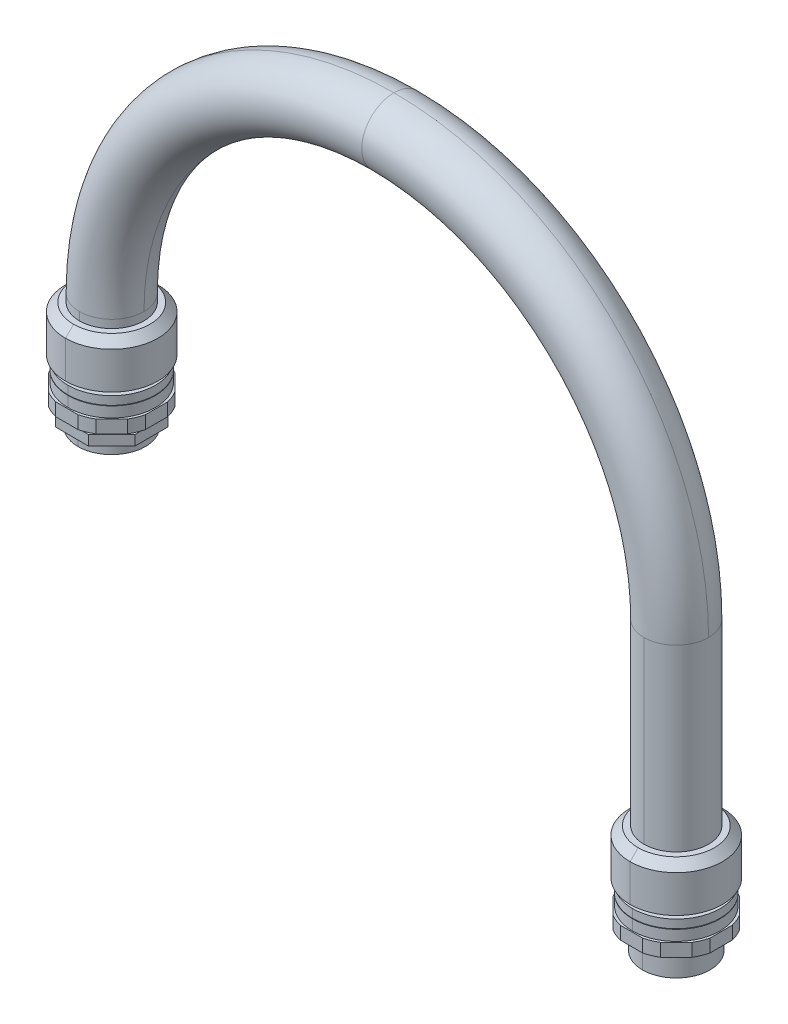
ISO-10303-21;
HEADER;
FILE_DESCRIPTION(('STEP AP214'),'2;1');
FILE_NAME('part.step','',(''),(''),'','','');
FILE_SCHEMA(('AUTOMOTIVE_DESIGN { 1 0 10303 214 1 1 1 1 }'));
ENDSEC;
DATA;
#1=APPLICATION_CONTEXT('core data for automotive mechanical design processes');
#2=APPLICATION_PROTOCOL_DEFINITION('international standard','automotive_design',2000,#1);
#3=PRODUCT_CONTEXT('',#1,'mechanical');
#4=PRODUCT('Part','Part','',(#3));
#5=PRODUCT_RELATED_PRODUCT_CATEGORY('part','',(#4));
#6=PRODUCT_DEFINITION_FORMATION('','',#4);
#7=PRODUCT_DEFINITION_CONTEXT('part definition',#1,'design');
#8=PRODUCT_DEFINITION('design','',#6,#7);
#9=PRODUCT_DEFINITION_SHAPE('','',#8);
#10=(LENGTH_UNIT() NAMED_UNIT(*) SI_UNIT(.MILLI.,.METRE.));
#11=(NAMED_UNIT(*) PLANE_ANGLE_UNIT() SI_UNIT($,.RADIAN.));
#12=(NAMED_UNIT(*) SI_UNIT($,.STERADIAN.) SOLID_ANGLE_UNIT());
#13=UNCERTAINTY_MEASURE_WITH_UNIT(LENGTH_MEASURE(1.E-05),#10,'distance_accuracy_value','');
#14=(GEOMETRIC_REPRESENTATION_CONTEXT(3) GLOBAL_UNCERTAINTY_ASSIGNED_CONTEXT((#13)) GLOBAL_UNIT_ASSIGNED_CONTEXT((#10,
#11,#12)) REPRESENTATION_CONTEXT('',''));
#15=CARTESIAN_POINT('',(0.,0.,0.));
#16=DIRECTION('',(0.,0.,1.));
#17=DIRECTION('',(1.,0.,0.));
#18=AXIS2_PLACEMENT_3D('',#15,#16,#17);
#19=CARTESIAN_POINT('',(-322.9,130.,0.));
#20=DIRECTION('',(0.,-1.,0.));
#21=DIRECTION('',(0.,0.,-1.));
#22=AXIS2_PLACEMENT_3D('',#19,#20,#21);
#23=PLANE('',#22);
#24=CARTESIAN_POINT('',(-350.,130.,0.));
#25=DIRECTION('',(0.,1.,0.));
#26=DIRECTION('',(0.970331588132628,0.,-0.241778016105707));
#27=AXIS2_PLACEMENT_3D('',#24,#25,#26);
#28=CIRCLE('',#27,28.65);
#29=CARTESIAN_POINT('',(-322.2,130.,-6.926940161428));
#30=VERTEX_POINT('',#29);
#31=CARTESIAN_POINT('',(-325.444345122,130.,-14.75948215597));
#32=VERTEX_POINT('',#31);
#33=EDGE_CURVE('E10',#30,#32,#28,.T.);
#34=ORIENTED_EDGE('',*,*,#33,.T.);
#35=DIRECTION('',(-0.707106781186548,0.,-0.707106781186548));
#36=VECTOR('',#35,1.);
#37=CARTESIAN_POINT('',(-325.444345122,130.,-14.75948215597));
#38=LINE('',#37,#36);
#39=CARTESIAN_POINT('',(-335.240517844,130.,-24.55565487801));
#40=VERTEX_POINT('',#39);
#41=EDGE_CURVE('E26',#32,#40,#38,.T.);
#42=ORIENTED_EDGE('',*,*,#41,.T.);
#43=CARTESIAN_POINT('',(-350.,130.,0.));
#44=DIRECTION('',(0.,1.,0.));
#45=DIRECTION('',(0.515165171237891,0.,-0.857090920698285));
#46=AXIS2_PLACEMENT_3D('',#43,#44,#45);
#47=CIRCLE('',#46,28.65);
#48=CARTESIAN_POINT('',(-343.0730598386,130.,-27.8));
#49=VERTEX_POINT('',#48);
#50=EDGE_CURVE('E1144',#40,#49,#47,.T.);
#51=ORIENTED_EDGE('',*,*,#50,.T.);
#52=DIRECTION('',(-1.,0.,0.));
#53=VECTOR('',#52,1.);
#54=CARTESIAN_POINT('',(-343.0730598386,130.,-27.8));
#55=LINE('',#54,#53);
#56=CARTESIAN_POINT('',(-356.9269401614,130.,-27.8));
#57=VERTEX_POINT('',#56);
#58=EDGE_CURVE('E1151',#49,#57,#55,.T.);
#59=ORIENTED_EDGE('',*,*,#58,.T.);
#60=CARTESIAN_POINT('',(-350.,130.,0.));
#61=DIRECTION('',(0.,1.,0.));
#62=DIRECTION('',(-0.241778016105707,0.,-0.970331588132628));
#63=AXIS2_PLACEMENT_3D('',#60,#61,#62);
#64=CIRCLE('',#63,28.65);
#65=CARTESIAN_POINT('',(-364.759482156,130.,-24.555654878));
#66=VERTEX_POINT('',#65);
#67=EDGE_CURVE('E1102',#57,#66,#64,.T.);
#68=ORIENTED_EDGE('',*,*,#67,.T.);
#69=DIRECTION('',(-0.707106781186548,0.,0.707106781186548));
#70=VECTOR('',#69,1.);
#71=CARTESIAN_POINT('',(-364.759482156,130.,-24.555654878));
#72=LINE('',#71,#70);
#73=CARTESIAN_POINT('',(-374.555654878,130.,-14.75948215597));
#74=VERTEX_POINT('',#73);
#75=EDGE_CURVE('E1098',#66,#74,#72,.T.);
#76=ORIENTED_EDGE('',*,*,#75,.T.);
#77=CARTESIAN_POINT('',(-350.,130.,0.));
#78=DIRECTION('',(0.,1.,0.));
#79=DIRECTION('',(-0.857090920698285,0.,-0.515165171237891));
#80=AXIS2_PLACEMENT_3D('',#77,#78,#79);
#81=CIRCLE('',#80,28.65);
#82=CARTESIAN_POINT('',(-377.8,130.,-6.926940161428));
#83=VERTEX_POINT('',#82);
#84=EDGE_CURVE('E943',#74,#83,#81,.T.);
#85=ORIENTED_EDGE('',*,*,#84,.T.);
#86=DIRECTION('',(0.,0.,1.));
#87=VECTOR('',#86,1.);
#88=CARTESIAN_POINT('',(-377.8,130.,-6.926940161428));
#89=LINE('',#88,#87);
#90=CARTESIAN_POINT('',(-377.8,130.,6.926940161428));
#91=VERTEX_POINT('',#90);
#92=EDGE_CURVE('E940',#83,#91,#89,.T.);
#93=ORIENTED_EDGE('',*,*,#92,.T.);
#94=CARTESIAN_POINT('',(-350.,130.,0.));
#95=DIRECTION('',(0.,1.,0.));
#96=DIRECTION('',(-0.970331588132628,0.,0.241778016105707));
#97=AXIS2_PLACEMENT_3D('',#94,#95,#96);
#98=CIRCLE('',#97,28.65);
#99=CARTESIAN_POINT('',(-374.555654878,130.,14.75948215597));
#100=VERTEX_POINT('',#99);
#101=EDGE_CURVE('E944',#91,#100,#98,.T.);
#102=ORIENTED_EDGE('',*,*,#101,.T.);
#103=DIRECTION('',(0.707106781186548,0.,0.707106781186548));
#104=VECTOR('',#103,1.);
#105=CARTESIAN_POINT('',(-374.555654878,130.,14.75948215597));
#106=LINE('',#105,#104);
#107=CARTESIAN_POINT('',(-364.759482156,130.,24.55565487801));
#108=VERTEX_POINT('',#107);
#109=EDGE_CURVE('E1010',#100,#108,#106,.T.);
#110=ORIENTED_EDGE('',*,*,#109,.T.);
#111=CARTESIAN_POINT('',(-350.,130.,0.));
#112=DIRECTION('',(0.,1.,0.));
#113=DIRECTION('',(-0.515165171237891,0.,0.857090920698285));
#114=AXIS2_PLACEMENT_3D('',#111,#112,#113);
#115=CIRCLE('',#114,28.65);
#116=CARTESIAN_POINT('',(-356.9269401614,130.,27.8));
#117=VERTEX_POINT('',#116);
#118=EDGE_CURVE('E1029',#108,#117,#115,.T.);
#119=ORIENTED_EDGE('',*,*,#118,.T.);
#120=DIRECTION('',(1.,0.,0.));
#121=VECTOR('',#120,1.);
#122=CARTESIAN_POINT('',(-356.9269401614,130.,27.8));
#123=LINE('',#122,#121);
#124=CARTESIAN_POINT('',(-343.0730598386,130.,27.8));
#125=VERTEX_POINT('',#124);
#126=EDGE_CURVE('E688',#117,#125,#123,.T.);
#127=ORIENTED_EDGE('',*,*,#126,.T.);
#128=CARTESIAN_POINT('',(-350.,130.,0.));
#129=DIRECTION('',(0.,1.,0.));
#130=DIRECTION('',(0.241778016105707,0.,0.970331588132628));
#131=AXIS2_PLACEMENT_3D('',#128,#129,#130);
#132=CIRCLE('',#131,28.65);
#133=CARTESIAN_POINT('',(-335.240517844,130.,24.55565487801));
#134=VERTEX_POINT('',#133);
#135=EDGE_CURVE('E684',#125,#134,#132,.T.);
#136=ORIENTED_EDGE('',*,*,#135,.T.);
#137=DIRECTION('',(0.707106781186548,0.,-0.707106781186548));
#138=VECTOR('',#137,1.);
#139=CARTESIAN_POINT('',(-335.240517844,130.,24.55565487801));
#140=LINE('',#139,#138);
#141=CARTESIAN_POINT('',(-325.444345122,130.,14.75948215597));
#142=VERTEX_POINT('',#141);
#143=EDGE_CURVE('E689',#134,#142,#140,.T.);
#144=ORIENTED_EDGE('',*,*,#143,.T.);
#145=CARTESIAN_POINT('',(-350.,130.,0.));
#146=DIRECTION('',(0.,1.,0.));
#147=DIRECTION('',(0.857090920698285,0.,0.515165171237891));
#148=AXIS2_PLACEMENT_3D('',#145,#146,#147);
#149=CIRCLE('',#148,28.65);
#150=CARTESIAN_POINT('',(-322.2,130.,6.926940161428));
#151=VERTEX_POINT('',#150);
#152=EDGE_CURVE('E1078',#142,#151,#149,.T.);
#153=ORIENTED_EDGE('',*,*,#152,.T.);
#154=DIRECTION('',(0.,0.,-1.));
#155=VECTOR('',#154,1.);
#156=CARTESIAN_POINT('',(-322.2,130.,6.926940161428));
#157=LINE('',#156,#155);
#158=EDGE_CURVE('E1067',#151,#30,#157,.T.);
#159=ORIENTED_EDGE('',*,*,#158,.T.);
#160=EDGE_LOOP('',(#34,#42,#51,#59,#68,#76,#85,#93,#102,#110,#119,#127,#136,#144,#153,#159));
#161=FACE_BOUND('',#160,.T.);
#162=CARTESIAN_POINT('',(-350.,130.,0.));
#163=DIRECTION('',(0.,-1.,0.));
#164=DIRECTION('',(0.,0.,1.));
#165=AXIS2_PLACEMENT_3D('',#162,#163,#164);
#166=CIRCLE('',#165,27.1);
#167=CARTESIAN_POINT('',(-350.,130.,27.1));
#168=VERTEX_POINT('',#167);
#169=CARTESIAN_POINT('',(-350.,130.,-27.1));
#170=VERTEX_POINT('',#169);
#171=EDGE_CURVE('E682',#168,#170,#166,.T.);
#172=ORIENTED_EDGE('',*,*,#171,.T.);
#173=CARTESIAN_POINT('',(-350.,130.,0.));
#174=DIRECTION('',(0.,-1.,0.));
#175=DIRECTION('',(0.,0.,-1.));
#176=AXIS2_PLACEMENT_3D('',#173,#174,#175);
#177=CIRCLE('',#176,27.1);
#178=EDGE_CURVE('E679',#170,#168,#177,.T.);
#179=ORIENTED_EDGE('',*,*,#178,.T.);
#180=EDGE_LOOP('',(#172,#179));
#181=FACE_BOUND('',#180,.T.);
#182=ADVANCED_FACE('F15',(#161,#181),#23,.F.);
#183=CARTESIAN_POINT('',(-322.2,130.,-11.51513703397));
#184=DIRECTION('',(1.,0.,0.));
#185=DIRECTION('',(0.,1.,0.));
#186=AXIS2_PLACEMENT_3D('',#183,#184,#185);
#187=PLANE('',#186);
#188=DIRECTION('',(0.,0.,1.));
#189=VECTOR('',#188,1.);
#190=CARTESIAN_POINT('',(-322.2,122.,-6.926940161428));
#191=LINE('',#190,#189);
#192=CARTESIAN_POINT('',(-322.2,122.,-6.926940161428));
#193=VERTEX_POINT('',#192);
#194=CARTESIAN_POINT('',(-322.2,122.,6.926940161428));
#195=VERTEX_POINT('',#194);
#196=EDGE_CURVE('E1014',#193,#195,#191,.T.);
#197=ORIENTED_EDGE('',*,*,#196,.F.);
#198=DIRECTION('',(0.,-1.,0.));
#199=VECTOR('',#198,1.);
#200=CARTESIAN_POINT('',(-322.2,130.,-6.926940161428));
#201=LINE('',#200,#199);
#202=EDGE_CURVE('E813',#30,#193,#201,.T.);
#203=ORIENTED_EDGE('',*,*,#202,.F.);
#204=ORIENTED_EDGE('',*,*,#158,.F.);
#205=DIRECTION('',(0.,1.,0.));
#206=VECTOR('',#205,1.);
#207=CARTESIAN_POINT('',(-322.2,122.,6.926940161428));
#208=LINE('',#207,#206);
#209=EDGE_CURVE('E683',#195,#151,#208,.T.);
#210=ORIENTED_EDGE('',*,*,#209,.F.);
#211=EDGE_LOOP('',(#197,#203,#204,#210));
#212=FACE_BOUND('',#211,.T.);
#213=ADVANCED_FACE('F1987',(#212),#187,.T.);
#214=CARTESIAN_POINT('',(-350.,106.,0.));
#215=DIRECTION('',(0.,-1.,0.));
#216=DIRECTION('',(0.,0.,-1.));
#217=AXIS2_PLACEMENT_3D('',#214,#215,#216);
#218=CYLINDRICAL_SURFACE('',#217,28.65);
#219=CARTESIAN_POINT('',(-350.,122.,0.));
#220=DIRECTION('',(0.,-1.,0.));
#221=DIRECTION('',(0.970331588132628,0.,0.241778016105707));
#222=AXIS2_PLACEMENT_3D('',#219,#220,#221);
#223=CIRCLE('',#222,28.65);
#224=CARTESIAN_POINT('',(-325.444345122,122.,14.75948215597));
#225=VERTEX_POINT('',#224);
#226=EDGE_CURVE('E1011',#195,#225,#223,.T.);
#227=ORIENTED_EDGE('',*,*,#226,.F.);
#228=ORIENTED_EDGE('',*,*,#209,.T.);
#229=ORIENTED_EDGE('',*,*,#152,.F.);
#230=DIRECTION('',(0.,-1.,0.));
#231=VECTOR('',#230,1.);
#232=CARTESIAN_POINT('',(-325.444345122,130.,14.75948215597));
#233=LINE('',#232,#231);
#234=EDGE_CURVE('E865',#142,#225,#233,.T.);
#235=ORIENTED_EDGE('',*,*,#234,.T.);
#236=EDGE_LOOP('',(#227,#228,#229,#235));
#237=FACE_BOUND('',#236,.T.);
#238=ADVANCED_FACE('F1982',(#237),#218,.T.);
#239=CARTESIAN_POINT('',(-322.2,130.,11.51513703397));
#240=DIRECTION('',(0.707106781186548,0.,0.707106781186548));
#241=DIRECTION('',(0.,-1.,0.));
#242=AXIS2_PLACEMENT_3D('',#239,#240,#241);
#243=PLANE('',#242);
#244=DIRECTION('',(-0.707106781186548,0.,0.707106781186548));
#245=VECTOR('',#244,1.);
#246=CARTESIAN_POINT('',(-325.444345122,122.,14.75948215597));
#247=LINE('',#246,#245);
#248=CARTESIAN_POINT('',(-335.240517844,122.,24.55565487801));
#249=VERTEX_POINT('',#248);
#250=EDGE_CURVE('E1015',#225,#249,#247,.T.);
#251=ORIENTED_EDGE('',*,*,#250,.F.);
#252=ORIENTED_EDGE('',*,*,#234,.F.);
#253=ORIENTED_EDGE('',*,*,#143,.F.);
#254=DIRECTION('',(0.,1.,0.));
#255=VECTOR('',#254,1.);
#256=CARTESIAN_POINT('',(-335.240517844,122.,24.55565487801));
#257=LINE('',#256,#255);
#258=EDGE_CURVE('E1025',#249,#134,#257,.T.);
#259=ORIENTED_EDGE('',*,*,#258,.F.);
#260=EDGE_LOOP('',(#251,#252,#253,#259));
#261=FACE_BOUND('',#260,.T.);
#262=ADVANCED_FACE('F1986',(#261),#243,.T.);
#263=CARTESIAN_POINT('',(-350.,106.,0.));
#264=DIRECTION('',(0.,-1.,0.));
#265=DIRECTION('',(0.,0.,-1.));
#266=AXIS2_PLACEMENT_3D('',#263,#264,#265);
#267=CYLINDRICAL_SURFACE('',#266,28.65);
#268=CARTESIAN_POINT('',(-350.,122.,0.));
#269=DIRECTION('',(0.,-1.,0.));
#270=DIRECTION('',(0.515165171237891,0.,0.857090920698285));
#271=AXIS2_PLACEMENT_3D('',#268,#269,#270);
#272=CIRCLE('',#271,28.65);
#273=CARTESIAN_POINT('',(-343.0730598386,122.,27.8));
#274=VERTEX_POINT('',#273);
#275=EDGE_CURVE('E1035',#249,#274,#272,.T.);
#276=ORIENTED_EDGE('',*,*,#275,.F.);
#277=ORIENTED_EDGE('',*,*,#258,.T.);
#278=ORIENTED_EDGE('',*,*,#135,.F.);
#279=DIRECTION('',(0.,-1.,0.));
#280=VECTOR('',#279,1.);
#281=CARTESIAN_POINT('',(-343.0730598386,130.,27.8));
#282=LINE('',#281,#280);
#283=EDGE_CURVE('E1094',#125,#274,#282,.T.);
#284=ORIENTED_EDGE('',*,*,#283,.T.);
#285=EDGE_LOOP('',(#276,#277,#278,#284));
#286=FACE_BOUND('',#285,.T.);
#287=ADVANCED_FACE('F2116',(#286),#267,.T.);
#288=CARTESIAN_POINT('',(-338.484862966,130.,27.8));
#289=DIRECTION('',(0.,0.,1.));
#290=DIRECTION('',(1.,0.,0.));
#291=AXIS2_PLACEMENT_3D('',#288,#289,#290);
#292=PLANE('',#291);
#293=DIRECTION('',(-1.,0.,0.));
#294=VECTOR('',#293,1.);
#295=CARTESIAN_POINT('',(-343.0730598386,122.,27.8));
#296=LINE('',#295,#294);
#297=CARTESIAN_POINT('',(-356.9269401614,122.,27.8));
#298=VERTEX_POINT('',#297);
#299=EDGE_CURVE('E775',#274,#298,#296,.T.);
#300=ORIENTED_EDGE('',*,*,#299,.F.);
#301=ORIENTED_EDGE('',*,*,#283,.F.);
#302=ORIENTED_EDGE('',*,*,#126,.F.);
#303=DIRECTION('',(0.,1.,0.));
#304=VECTOR('',#303,1.);
#305=CARTESIAN_POINT('',(-356.9269401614,122.,27.8));
#306=LINE('',#305,#304);
#307=EDGE_CURVE('E969',#298,#117,#306,.T.);
#308=ORIENTED_EDGE('',*,*,#307,.F.);
#309=EDGE_LOOP('',(#300,#301,#302,#308));
#310=FACE_BOUND('',#309,.T.);
#311=ADVANCED_FACE('F1702',(#310),#292,.T.);
#312=CARTESIAN_POINT('',(-350.,106.,0.));
#313=DIRECTION('',(0.,-1.,0.));
#314=DIRECTION('',(0.,0.,-1.));
#315=AXIS2_PLACEMENT_3D('',#312,#313,#314);
#316=CYLINDRICAL_SURFACE('',#315,28.65);
#317=CARTESIAN_POINT('',(-350.,122.,0.));
#318=DIRECTION('',(0.,-1.,0.));
#319=DIRECTION('',(-0.241778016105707,0.,0.970331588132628));
#320=AXIS2_PLACEMENT_3D('',#317,#318,#319);
#321=CIRCLE('',#320,28.65);
#322=CARTESIAN_POINT('',(-364.759482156,122.,24.55565487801));
#323=VERTEX_POINT('',#322);
#324=EDGE_CURVE('E771',#298,#323,#321,.T.);
#325=ORIENTED_EDGE('',*,*,#324,.F.);
#326=ORIENTED_EDGE('',*,*,#307,.T.);
#327=ORIENTED_EDGE('',*,*,#118,.F.);
#328=DIRECTION('',(0.,-1.,0.));
#329=VECTOR('',#328,1.);
#330=CARTESIAN_POINT('',(-364.759482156,130.,24.55565487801));
#331=LINE('',#330,#329);
#332=EDGE_CURVE('E965',#108,#323,#331,.T.);
#333=ORIENTED_EDGE('',*,*,#332,.T.);
#334=EDGE_LOOP('',(#325,#326,#327,#333));
#335=FACE_BOUND('',#334,.T.);
#336=ADVANCED_FACE('F1697',(#335),#316,.T.);
#337=CARTESIAN_POINT('',(-361.515137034,130.,27.8));
#338=DIRECTION('',(-0.707106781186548,0.,0.707106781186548));
#339=DIRECTION('',(0.,1.,0.));
#340=AXIS2_PLACEMENT_3D('',#337,#338,#339);
#341=PLANE('',#340);
#342=DIRECTION('',(-0.707106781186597,0.,-0.707106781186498));
#343=VECTOR('',#342,1.);
#344=CARTESIAN_POINT('',(-364.759482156,122.,24.55565487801));
#345=LINE('',#344,#343);
#346=CARTESIAN_POINT('',(-374.555654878,122.,14.75948215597));
#347=VERTEX_POINT('',#346);
#348=EDGE_CURVE('E668',#323,#347,#345,.T.);
#349=ORIENTED_EDGE('',*,*,#348,.F.);
#350=ORIENTED_EDGE('',*,*,#332,.F.);
#351=ORIENTED_EDGE('',*,*,#109,.F.);
#352=DIRECTION('',(0.,1.,0.));
#353=VECTOR('',#352,1.);
#354=CARTESIAN_POINT('',(-374.555654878,122.,14.75948215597));
#355=LINE('',#354,#353);
#356=EDGE_CURVE('E1311',#347,#100,#355,.T.);
#357=ORIENTED_EDGE('',*,*,#356,.F.);
#358=EDGE_LOOP('',(#349,#350,#351,#357));
#359=FACE_BOUND('',#358,.T.);
#360=ADVANCED_FACE('F1701',(#359),#341,.T.);
#361=CARTESIAN_POINT('',(-350.,106.,0.));
#362=DIRECTION('',(0.,-1.,0.));
#363=DIRECTION('',(0.,0.,-1.));
#364=AXIS2_PLACEMENT_3D('',#361,#362,#363);
#365=CYLINDRICAL_SURFACE('',#364,28.65);
#366=ORIENTED_EDGE('',*,*,#101,.F.);
#367=DIRECTION('',(0.,-1.,0.));
#368=VECTOR('',#367,1.);
#369=CARTESIAN_POINT('',(-377.8,130.,6.926940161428));
#370=LINE('',#369,#368);
#371=CARTESIAN_POINT('',(-377.8,122.,6.926940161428));
#372=VERTEX_POINT('',#371);
#373=EDGE_CURVE('E970',#91,#372,#370,.T.);
#374=ORIENTED_EDGE('',*,*,#373,.T.);
#375=CARTESIAN_POINT('',(-350.,122.,0.));
#376=DIRECTION('',(0.,-1.,0.));
#377=DIRECTION('',(-0.857090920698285,0.,0.515165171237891));
#378=AXIS2_PLACEMENT_3D('',#375,#376,#377);
#379=CIRCLE('',#378,28.65);
#380=EDGE_CURVE('E819',#347,#372,#379,.T.);
#381=ORIENTED_EDGE('',*,*,#380,.F.);
#382=ORIENTED_EDGE('',*,*,#356,.T.);
#383=EDGE_LOOP('',(#366,#374,#381,#382));
#384=FACE_BOUND('',#383,.T.);
#385=ADVANCED_FACE('F1910',(#384),#365,.T.);
#386=CARTESIAN_POINT('',(-321.35,122.,0.));
#387=DIRECTION('',(0.,1.,0.));
#388=DIRECTION('',(1.,0.,0.));
#389=AXIS2_PLACEMENT_3D('',#386,#387,#388);
#390=PLANE('',#389);
#391=ORIENTED_EDGE('',*,*,#380,.T.);
#392=DIRECTION('',(0.,0.,-1.));
#393=VECTOR('',#392,1.);
#394=CARTESIAN_POINT('',(-377.8,122.,6.926940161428));
#395=LINE('',#394,#393);
#396=CARTESIAN_POINT('',(-377.8,122.,-6.926940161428));
#397=VERTEX_POINT('',#396);
#398=EDGE_CURVE('E816',#372,#397,#395,.T.);
#399=ORIENTED_EDGE('',*,*,#398,.T.);
#400=CARTESIAN_POINT('',(-350.,122.,0.));
#401=DIRECTION('',(0.,-1.,0.));
#402=DIRECTION('',(-0.970331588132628,0.,-0.241778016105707));
#403=AXIS2_PLACEMENT_3D('',#400,#401,#402);
#404=CIRCLE('',#403,28.65);
#405=CARTESIAN_POINT('',(-374.555654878,122.,-14.75948215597));
#406=VERTEX_POINT('',#405);
#407=EDGE_CURVE('E820',#397,#406,#404,.T.);
#408=ORIENTED_EDGE('',*,*,#407,.T.);
#409=DIRECTION('',(0.707106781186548,0.,-0.707106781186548));
#410=VECTOR('',#409,1.);
#411=CARTESIAN_POINT('',(-374.555654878,122.,-14.75948215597));
#412=LINE('',#411,#410);
#413=CARTESIAN_POINT('',(-364.759482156,122.,-24.55565487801));
#414=VERTEX_POINT('',#413);
#415=EDGE_CURVE('E1203',#406,#414,#412,.T.);
#416=ORIENTED_EDGE('',*,*,#415,.T.);
#417=CARTESIAN_POINT('',(-350.,122.,0.));
#418=DIRECTION('',(0.,-1.,0.));
#419=DIRECTION('',(-0.515165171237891,0.,-0.857090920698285));
#420=AXIS2_PLACEMENT_3D('',#417,#418,#419);
#421=CIRCLE('',#420,28.65);
#422=CARTESIAN_POINT('',(-356.9269401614,122.,-27.8));
#423=VERTEX_POINT('',#422);
#424=EDGE_CURVE('E1207',#414,#423,#421,.T.);
#425=ORIENTED_EDGE('',*,*,#424,.T.);
#426=DIRECTION('',(1.,0.,0.));
#427=VECTOR('',#426,1.);
#428=CARTESIAN_POINT('',(-356.9269401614,122.,-27.8));
#429=LINE('',#428,#427);
#430=CARTESIAN_POINT('',(-343.0730598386,122.,-27.8));
#431=VERTEX_POINT('',#430);
#432=EDGE_CURVE('E1238',#423,#431,#429,.T.);
#433=ORIENTED_EDGE('',*,*,#432,.T.);
#434=CARTESIAN_POINT('',(-350.,122.,0.));
#435=DIRECTION('',(0.,-1.,0.));
#436=DIRECTION('',(0.241778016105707,0.,-0.970331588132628));
#437=AXIS2_PLACEMENT_3D('',#434,#435,#436);
#438=CIRCLE('',#437,28.65);
#439=CARTESIAN_POINT('',(-335.240517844,122.,-24.555654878));
#440=VERTEX_POINT('',#439);
#441=EDGE_CURVE('E757',#431,#440,#438,.T.);
#442=ORIENTED_EDGE('',*,*,#441,.T.);
#443=DIRECTION('',(0.707106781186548,0.,0.707106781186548));
#444=VECTOR('',#443,1.);
#445=CARTESIAN_POINT('',(-335.240517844,122.,-24.555654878));
#446=LINE('',#445,#444);
#447=CARTESIAN_POINT('',(-325.444345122,122.,-14.75948215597));
#448=VERTEX_POINT('',#447);
#449=EDGE_CURVE('E753',#440,#448,#446,.T.);
#450=ORIENTED_EDGE('',*,*,#449,.T.);
#451=CARTESIAN_POINT('',(-350.,122.,0.));
#452=DIRECTION('',(0.,-1.,0.));
#453=DIRECTION('',(0.857090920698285,0.,-0.515165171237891));
#454=AXIS2_PLACEMENT_3D('',#451,#452,#453);
#455=CIRCLE('',#454,28.65);
#456=EDGE_CURVE('E758',#448,#193,#455,.T.);
#457=ORIENTED_EDGE('',*,*,#456,.T.);
#458=ORIENTED_EDGE('',*,*,#196,.T.);
#459=ORIENTED_EDGE('',*,*,#226,.T.);
#460=ORIENTED_EDGE('',*,*,#250,.T.);
#461=ORIENTED_EDGE('',*,*,#275,.T.);
#462=ORIENTED_EDGE('',*,*,#299,.T.);
#463=ORIENTED_EDGE('',*,*,#324,.T.);
#464=ORIENTED_EDGE('',*,*,#348,.T.);
#465=EDGE_LOOP('',(#391,#399,#408,#416,#425,#433,#442,#450,#457,#458,#459,#460,#461,#462,#463,#464));
#466=FACE_BOUND('',#465,.T.);
#467=CARTESIAN_POINT('',(-350.,122.,0.));
#468=DIRECTION('',(0.,1.,0.));
#469=DIRECTION('',(0.,0.,1.));
#470=AXIS2_PLACEMENT_3D('',#467,#468,#469);
#471=CIRCLE('',#470,20.95);
#472=CARTESIAN_POINT('',(-350.,122.,20.95));
#473=VERTEX_POINT('',#472);
#474=CARTESIAN_POINT('',(-350.,122.,-20.95));
#475=VERTEX_POINT('',#474);
#476=EDGE_CURVE('E664',#473,#475,#471,.T.);
#477=ORIENTED_EDGE('',*,*,#476,.T.);
#478=CARTESIAN_POINT('',(-350.,122.,0.));
#479=DIRECTION('',(0.,1.,0.));
#480=DIRECTION('',(0.,0.,-1.));
#481=AXIS2_PLACEMENT_3D('',#478,#479,#480);
#482=CIRCLE('',#481,20.95);
#483=EDGE_CURVE('E669',#475,#473,#482,.T.);
#484=ORIENTED_EDGE('',*,*,#483,.T.);
#485=EDGE_LOOP('',(#477,#484));
#486=FACE_BOUND('',#485,.T.);
#487=ADVANCED_FACE('F2454',(#466,#486),#390,.F.);
#488=CARTESIAN_POINT('',(-350.,106.,0.));
#489=DIRECTION('',(0.,-1.,0.));
#490=DIRECTION('',(0.,0.,-1.));
#491=AXIS2_PLACEMENT_3D('',#488,#489,#490);
#492=CYLINDRICAL_SURFACE('',#491,20.95);
#493=DIRECTION('',(0.,-1.,0.));
#494=VECTOR('',#493,1.);
#495=CARTESIAN_POINT('',(-350.,122.,20.95));
#496=LINE('',#495,#494);
#497=CARTESIAN_POINT('',(-350.,119.5,20.95));
#498=VERTEX_POINT('',#497);
#499=EDGE_CURVE('E987',#473,#498,#496,.T.);
#500=ORIENTED_EDGE('',*,*,#499,.F.);
#501=ORIENTED_EDGE('',*,*,#483,.F.);
#502=DIRECTION('',(0.,-1.,0.));
#503=VECTOR('',#502,1.);
#504=CARTESIAN_POINT('',(-350.,122.,-20.95));
#505=LINE('',#504,#503);
#506=CARTESIAN_POINT('',(-350.,119.5,-20.95));
#507=VERTEX_POINT('',#506);
#508=EDGE_CURVE('E1294',#475,#507,#505,.T.);
#509=ORIENTED_EDGE('',*,*,#508,.T.);
#510=CARTESIAN_POINT('',(-350.,119.5,0.));
#511=DIRECTION('',(0.,-1.,0.));
#512=DIRECTION('',(0.,0.,1.));
#513=AXIS2_PLACEMENT_3D('',#510,#511,#512);
#514=CIRCLE('',#513,20.95);
#515=EDGE_CURVE('E983',#498,#507,#514,.T.);
#516=ORIENTED_EDGE('',*,*,#515,.F.);
#517=EDGE_LOOP('',(#500,#501,#509,#516));
#518=FACE_BOUND('',#517,.T.);
#519=ADVANCED_FACE('F1888',(#518),#492,.T.);
#520=CARTESIAN_POINT('',(0.,119.5,0.));
#521=DIRECTION('',(0.,1.,0.));
#522=DIRECTION('',(1.,0.,0.));
#523=AXIS2_PLACEMENT_3D('',#520,#521,#522);
#524=PLANE('',#523);
#525=DIRECTION('',(0.707106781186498,0.,0.707106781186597));
#526=VECTOR('',#525,1.);
#527=CARTESIAN_POINT('',(-374.6999193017,119.5,10.23104156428));
#528=LINE('',#527,#526);
#529=CARTESIAN_POINT('',(-374.6999193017,119.5,10.23104156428));
#530=VERTEX_POINT('',#529);
#531=CARTESIAN_POINT('',(-360.2310415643,119.5,24.69991930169));
#532=VERTEX_POINT('',#531);
#533=EDGE_CURVE('E1333',#530,#532,#528,.T.);
#534=ORIENTED_EDGE('',*,*,#533,.T.);
#535=DIRECTION('',(-1.,0.,0.));
#536=VECTOR('',#535,1.);
#537=CARTESIAN_POINT('',(-339.7689584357,119.5,24.69991930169));
#538=LINE('',#537,#536);
#539=CARTESIAN_POINT('',(-339.7689584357,119.5,24.69991930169));
#540=VERTEX_POINT('',#539);
#541=EDGE_CURVE('E1173',#540,#532,#538,.T.);
#542=ORIENTED_EDGE('',*,*,#541,.F.);
#543=DIRECTION('',(0.707106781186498,0.,-0.707106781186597));
#544=VECTOR('',#543,1.);
#545=CARTESIAN_POINT('',(-339.7689584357,119.5,24.69991930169));
#546=LINE('',#545,#544);
#547=CARTESIAN_POINT('',(-325.3000806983,119.5,10.23104156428));
#548=VERTEX_POINT('',#547);
#549=EDGE_CURVE('E798',#540,#548,#546,.T.);
#550=ORIENTED_EDGE('',*,*,#549,.T.);
#551=DIRECTION('',(0.,0.,1.));
#552=VECTOR('',#551,1.);
#553=CARTESIAN_POINT('',(-325.3000806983,119.5,-10.23104156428));
#554=LINE('',#553,#552);
#555=CARTESIAN_POINT('',(-325.3000806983,119.5,-10.23104156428));
#556=VERTEX_POINT('',#555);
#557=EDGE_CURVE('E899',#556,#548,#554,.T.);
#558=ORIENTED_EDGE('',*,*,#557,.F.);
#559=DIRECTION('',(-0.707106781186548,0.,-0.707106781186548));
#560=VECTOR('',#559,1.);
#561=CARTESIAN_POINT('',(-325.3000806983,119.5,-10.23104156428));
#562=LINE('',#561,#560);
#563=CARTESIAN_POINT('',(-339.7689584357,119.5,-24.69991930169));
#564=VERTEX_POINT('',#563);
#565=EDGE_CURVE('E794',#556,#564,#562,.T.);
#566=ORIENTED_EDGE('',*,*,#565,.T.);
#567=DIRECTION('',(1.,0.,0.));
#568=VECTOR('',#567,1.);
#569=CARTESIAN_POINT('',(-360.2310415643,119.5,-24.69991930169));
#570=LINE('',#569,#568);
#571=CARTESIAN_POINT('',(-360.2310415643,119.5,-24.69991930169));
#572=VERTEX_POINT('',#571);
#573=EDGE_CURVE('E709',#572,#564,#570,.T.);
#574=ORIENTED_EDGE('',*,*,#573,.F.);
#575=DIRECTION('',(-0.707106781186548,0.,0.707106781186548));
#576=VECTOR('',#575,1.);
#577=CARTESIAN_POINT('',(-360.2310415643,119.5,-24.69991930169));
#578=LINE('',#577,#576);
#579=CARTESIAN_POINT('',(-374.6999193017,119.5,-10.23104156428));
#580=VERTEX_POINT('',#579);
#581=EDGE_CURVE('E799',#572,#580,#578,.T.);
#582=ORIENTED_EDGE('',*,*,#581,.T.);
#583=DIRECTION('',(0.,0.,-1.));
#584=VECTOR('',#583,1.);
#585=CARTESIAN_POINT('',(-374.6999193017,119.5,10.23104156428));
#586=LINE('',#585,#584);
#587=EDGE_CURVE('E727',#530,#580,#586,.T.);
#588=ORIENTED_EDGE('',*,*,#587,.F.);
#589=EDGE_LOOP('',(#534,#542,#550,#558,#566,#574,#582,#588));
#590=FACE_BOUND('',#589,.T.);
#591=CARTESIAN_POINT('',(-350.,119.5,0.));
#592=DIRECTION('',(0.,-1.,0.));
#593=DIRECTION('',(0.,0.,-1.));
#594=AXIS2_PLACEMENT_3D('',#591,#592,#593);
#595=CIRCLE('',#594,20.95);
#596=EDGE_CURVE('E986',#507,#498,#595,.T.);
#597=ORIENTED_EDGE('',*,*,#596,.T.);
#598=ORIENTED_EDGE('',*,*,#515,.T.);
#599=EDGE_LOOP('',(#597,#598));
#600=FACE_BOUND('',#599,.T.);
#601=ADVANCED_FACE('F1449',(#590,#600),#524,.T.);
#602=CARTESIAN_POINT('',(-350.,106.,0.));
#603=DIRECTION('',(0.,-1.,0.));
#604=DIRECTION('',(0.,0.,-1.));
#605=AXIS2_PLACEMENT_3D('',#602,#603,#604);
#606=CYLINDRICAL_SURFACE('',#605,20.95);
#607=ORIENTED_EDGE('',*,*,#508,.F.);
#608=ORIENTED_EDGE('',*,*,#476,.F.);
#609=ORIENTED_EDGE('',*,*,#499,.T.);
#610=ORIENTED_EDGE('',*,*,#596,.F.);
#611=EDGE_LOOP('',(#607,#608,#609,#610));
#612=FACE_BOUND('',#611,.T.);
#613=ADVANCED_FACE('F1887',(#612),#606,.T.);
#614=CARTESIAN_POINT('',(-374.6999193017,119.5,-10.23104156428));
#615=DIRECTION('',(1.,0.,0.));
#616=DIRECTION('',(0.,1.,0.));
#617=AXIS2_PLACEMENT_3D('',#614,#615,#616);
#618=PLANE('',#617);
#619=DIRECTION('',(0.,1.,0.));
#620=VECTOR('',#619,1.);
#621=CARTESIAN_POINT('',(-374.6999193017,113.3,10.23104156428));
#622=LINE('',#621,#620);
#623=CARTESIAN_POINT('',(-374.6999193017,113.3,10.23104156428));
#624=VERTEX_POINT('',#623);
#625=EDGE_CURVE('E1036',#624,#530,#622,.T.);
#626=ORIENTED_EDGE('',*,*,#625,.T.);
#627=ORIENTED_EDGE('',*,*,#587,.T.);
#628=DIRECTION('',(0.,1.,0.));
#629=VECTOR('',#628,1.);
#630=CARTESIAN_POINT('',(-374.6999193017,113.3,-10.23104156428));
#631=LINE('',#630,#629);
#632=CARTESIAN_POINT('',(-374.6999193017,113.3,-10.23104156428));
#633=VERTEX_POINT('',#632);
#634=EDGE_CURVE('E705',#633,#580,#631,.T.);
#635=ORIENTED_EDGE('',*,*,#634,.F.);
#636=DIRECTION('',(0.,0.,-1.));
#637=VECTOR('',#636,1.);
#638=CARTESIAN_POINT('',(-374.6999193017,113.3,10.23104156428));
#639=LINE('',#638,#637);
#640=EDGE_CURVE('E974',#624,#633,#639,.T.);
#641=ORIENTED_EDGE('',*,*,#640,.F.);
#642=EDGE_LOOP('',(#626,#627,#635,#641));
#643=FACE_BOUND('',#642,.T.);
#644=ADVANCED_FACE('F1476',(#643),#618,.F.);
#645=CARTESIAN_POINT('',(0.,113.3,0.));
#646=DIRECTION('',(0.,1.,0.));
#647=DIRECTION('',(1.,0.,0.));
#648=AXIS2_PLACEMENT_3D('',#645,#646,#647);
#649=PLANE('',#648);
#650=DIRECTION('',(0.707106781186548,0.,-0.707106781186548));
#651=VECTOR('',#650,1.);
#652=CARTESIAN_POINT('',(-374.6999193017,113.3,-10.23104156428));
#653=LINE('',#652,#651);
#654=CARTESIAN_POINT('',(-360.2310415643,113.3,-24.69991930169));
#655=VERTEX_POINT('',#654);
#656=EDGE_CURVE('E723',#633,#655,#653,.T.);
#657=ORIENTED_EDGE('',*,*,#656,.T.);
#658=DIRECTION('',(1.,0.,0.));
#659=VECTOR('',#658,1.);
#660=CARTESIAN_POINT('',(-360.2310415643,113.3,-24.69991930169));
#661=LINE('',#660,#659);
#662=CARTESIAN_POINT('',(-339.7689584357,113.3,-24.69991930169));
#663=VERTEX_POINT('',#662);
#664=EDGE_CURVE('E728',#655,#663,#661,.T.);
#665=ORIENTED_EDGE('',*,*,#664,.T.);
#666=DIRECTION('',(0.707106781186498,0.,0.707106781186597));
#667=VECTOR('',#666,1.);
#668=CARTESIAN_POINT('',(-339.7689584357,113.3,-24.69991930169));
#669=LINE('',#668,#667);
#670=CARTESIAN_POINT('',(-325.3000806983,113.3,-10.23104156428));
#671=VERTEX_POINT('',#670);
#672=EDGE_CURVE('E870',#663,#671,#669,.T.);
#673=ORIENTED_EDGE('',*,*,#672,.T.);
#674=DIRECTION('',(0.,0.,1.));
#675=VECTOR('',#674,1.);
#676=CARTESIAN_POINT('',(-325.3000806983,113.3,-10.23104156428));
#677=LINE('',#676,#675);
#678=CARTESIAN_POINT('',(-325.3000806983,113.3,10.23104156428));
#679=VERTEX_POINT('',#678);
#680=EDGE_CURVE('E866',#671,#679,#677,.T.);
#681=ORIENTED_EDGE('',*,*,#680,.T.);
#682=DIRECTION('',(-0.707106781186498,0.,0.707106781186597));
#683=VECTOR('',#682,1.);
#684=CARTESIAN_POINT('',(-325.3000806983,113.3,10.23104156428));
#685=LINE('',#684,#683);
#686=CARTESIAN_POINT('',(-339.7689584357,113.3,24.69991930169));
#687=VERTEX_POINT('',#686);
#688=EDGE_CURVE('E786',#679,#687,#685,.T.);
#689=ORIENTED_EDGE('',*,*,#688,.T.);
#690=DIRECTION('',(-1.,0.,0.));
#691=VECTOR('',#690,1.);
#692=CARTESIAN_POINT('',(-339.7689584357,113.3,24.69991930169));
#693=LINE('',#692,#691);
#694=CARTESIAN_POINT('',(-360.2310415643,113.3,24.69991930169));
#695=VERTEX_POINT('',#694);
#696=EDGE_CURVE('E782',#687,#695,#693,.T.);
#697=ORIENTED_EDGE('',*,*,#696,.T.);
#698=DIRECTION('',(-0.707106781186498,0.,-0.707106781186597));
#699=VECTOR('',#698,1.);
#700=CARTESIAN_POINT('',(-360.2310415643,113.3,24.69991930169));
#701=LINE('',#700,#699);
#702=EDGE_CURVE('E787',#695,#624,#701,.T.);
#703=ORIENTED_EDGE('',*,*,#702,.T.);
#704=ORIENTED_EDGE('',*,*,#640,.T.);
#705=EDGE_LOOP('',(#657,#665,#673,#681,#689,#697,#703,#704));
#706=FACE_BOUND('',#705,.T.);
#707=CARTESIAN_POINT('',(-350.,113.3,0.));
#708=DIRECTION('',(0.,1.,0.));
#709=DIRECTION('',(0.,0.,-1.));
#710=AXIS2_PLACEMENT_3D('',#707,#708,#709);
#711=CIRCLE('',#710,20.95);
#712=CARTESIAN_POINT('',(-350.,113.3,-20.95));
#713=VERTEX_POINT('',#712);
#714=CARTESIAN_POINT('',(-350.,113.3,20.95));
#715=VERTEX_POINT('',#714);
#716=EDGE_CURVE('E1032',#713,#715,#711,.T.);
#717=ORIENTED_EDGE('',*,*,#716,.T.);
#718=CARTESIAN_POINT('',(-350.,113.3,0.));
#719=DIRECTION('',(0.,1.,0.));
#720=DIRECTION('',(0.,0.,1.));
#721=AXIS2_PLACEMENT_3D('',#718,#719,#720);
#722=CIRCLE('',#721,20.95);
#723=EDGE_CURVE('E840',#715,#713,#722,.T.);
#724=ORIENTED_EDGE('',*,*,#723,.T.);
#725=EDGE_LOOP('',(#717,#724));
#726=FACE_BOUND('',#725,.T.);
#727=ADVANCED_FACE('F1459',(#706,#726),#649,.F.);
#728=CARTESIAN_POINT('',(-350.,106.,0.));
#729=DIRECTION('',(0.,-1.,0.));
#730=DIRECTION('',(0.,0.,-1.));
#731=AXIS2_PLACEMENT_3D('',#728,#729,#730);
#732=CYLINDRICAL_SURFACE('',#731,20.95);
#733=DIRECTION('',(0.,-1.,0.));
#734=VECTOR('',#733,1.);
#735=CARTESIAN_POINT('',(-350.,113.3,-20.95));
#736=LINE('',#735,#734);
#737=CARTESIAN_POINT('',(-350.,106.,-20.95));
#738=VERTEX_POINT('',#737);
#739=EDGE_CURVE('E845',#713,#738,#736,.T.);
#740=ORIENTED_EDGE('',*,*,#739,.F.);
#741=ORIENTED_EDGE('',*,*,#723,.F.);
#742=DIRECTION('',(0.,-1.,0.));
#743=VECTOR('',#742,1.);
#744=CARTESIAN_POINT('',(-350.,113.3,20.95));
#745=LINE('',#744,#743);
#746=CARTESIAN_POINT('',(-350.,106.,20.95));
#747=VERTEX_POINT('',#746);
#748=EDGE_CURVE('E836',#715,#747,#745,.T.);
#749=ORIENTED_EDGE('',*,*,#748,.T.);
#750=CARTESIAN_POINT('',(-350.,106.,0.));
#751=DIRECTION('',(0.,-1.,0.));
#752=DIRECTION('',(0.,0.,-1.));
#753=AXIS2_PLACEMENT_3D('',#750,#751,#752);
#754=CIRCLE('',#753,20.95);
#755=EDGE_CURVE('E842',#738,#747,#754,.T.);
#756=ORIENTED_EDGE('',*,*,#755,.F.);
#757=EDGE_LOOP('',(#740,#741,#749,#756));
#758=FACE_BOUND('',#757,.T.);
#759=ADVANCED_FACE('F1801',(#758),#732,.T.);
#760=CARTESIAN_POINT('',(-329.05,106.,0.));
#761=DIRECTION('',(0.,1.,0.));
#762=DIRECTION('',(1.,0.,0.));
#763=AXIS2_PLACEMENT_3D('',#760,#761,#762);
#764=PLANE('',#763);
#765=CARTESIAN_POINT('',(-350.,106.,0.));
#766=DIRECTION('',(0.,-1.,0.));
#767=DIRECTION('',(0.,0.,1.));
#768=AXIS2_PLACEMENT_3D('',#765,#766,#767);
#769=CIRCLE('',#768,20.95);
#770=EDGE_CURVE('E841',#747,#738,#769,.T.);
#771=ORIENTED_EDGE('',*,*,#770,.T.);
#772=ORIENTED_EDGE('',*,*,#755,.T.);
#773=EDGE_LOOP('',(#771,#772));
#774=FACE_BOUND('',#773,.T.);
#775=ADVANCED_FACE('F1552',(#774),#764,.F.);
#776=CARTESIAN_POINT('',(-350.,106.,0.));
#777=DIRECTION('',(0.,-1.,0.));
#778=DIRECTION('',(0.,0.,-1.));
#779=AXIS2_PLACEMENT_3D('',#776,#777,#778);
#780=CYLINDRICAL_SURFACE('',#779,20.95);
#781=ORIENTED_EDGE('',*,*,#748,.F.);
#782=ORIENTED_EDGE('',*,*,#716,.F.);
#783=ORIENTED_EDGE('',*,*,#739,.T.);
#784=ORIENTED_EDGE('',*,*,#770,.F.);
#785=EDGE_LOOP('',(#781,#782,#783,#784));
#786=FACE_BOUND('',#785,.T.);
#787=ADVANCED_FACE('F1548',(#786),#780,.T.);
#788=CARTESIAN_POINT('',(-374.6999193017,119.5,10.23104156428));
#789=DIRECTION('',(0.707106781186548,0.,-0.707106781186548));
#790=DIRECTION('',(0.,-1.,0.));
#791=AXIS2_PLACEMENT_3D('',#788,#789,#790);
#792=PLANE('',#791);
#793=DIRECTION('',(0.,1.,0.));
#794=VECTOR('',#793,1.);
#795=CARTESIAN_POINT('',(-360.2310415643,113.3,24.69991930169));
#796=LINE('',#795,#794);
#797=EDGE_CURVE('E978',#695,#532,#796,.T.);
#798=ORIENTED_EDGE('',*,*,#797,.T.);
#799=ORIENTED_EDGE('',*,*,#533,.F.);
#800=ORIENTED_EDGE('',*,*,#625,.F.);
#801=ORIENTED_EDGE('',*,*,#702,.F.);
#802=EDGE_LOOP('',(#798,#799,#800,#801));
#803=FACE_BOUND('',#802,.T.);
#804=ADVANCED_FACE('F1457',(#803),#792,.F.);
#805=CARTESIAN_POINT('',(-360.2310415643,119.5,24.69991930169));
#806=DIRECTION('',(0.,0.,-1.));
#807=DIRECTION('',(0.,-1.,0.));
#808=AXIS2_PLACEMENT_3D('',#805,#806,#807);
#809=PLANE('',#808);
#810=DIRECTION('',(0.,1.,0.));
#811=VECTOR('',#810,1.);
#812=CARTESIAN_POINT('',(-339.7689584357,113.3,24.69991930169));
#813=LINE('',#812,#811);
#814=EDGE_CURVE('E982',#687,#540,#813,.T.);
#815=ORIENTED_EDGE('',*,*,#814,.T.);
#816=ORIENTED_EDGE('',*,*,#541,.T.);
#817=ORIENTED_EDGE('',*,*,#797,.F.);
#818=ORIENTED_EDGE('',*,*,#696,.F.);
#819=EDGE_LOOP('',(#815,#816,#817,#818));
#820=FACE_BOUND('',#819,.T.);
#821=ADVANCED_FACE('F1440',(#820),#809,.F.);
#822=CARTESIAN_POINT('',(-339.7689584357,119.5,24.69991930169));
#823=DIRECTION('',(-0.707106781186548,0.,-0.707106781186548));
#824=DIRECTION('',(-0.707106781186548,0.,0.707106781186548));
#825=AXIS2_PLACEMENT_3D('',#822,#823,#824);
#826=PLANE('',#825);
#827=DIRECTION('',(0.,1.,0.));
#828=VECTOR('',#827,1.);
#829=CARTESIAN_POINT('',(-325.3000806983,113.3,10.23104156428));
#830=LINE('',#829,#828);
#831=EDGE_CURVE('E1176',#679,#548,#830,.T.);
#832=ORIENTED_EDGE('',*,*,#831,.T.);
#833=ORIENTED_EDGE('',*,*,#549,.F.);
#834=ORIENTED_EDGE('',*,*,#814,.F.);
#835=ORIENTED_EDGE('',*,*,#688,.F.);
#836=EDGE_LOOP('',(#832,#833,#834,#835));
#837=FACE_BOUND('',#836,.T.);
#838=ADVANCED_FACE('F1445',(#837),#826,.F.);
#839=CARTESIAN_POINT('',(-325.3000806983,119.5,10.23104156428));
#840=DIRECTION('',(-1.,0.,0.));
#841=DIRECTION('',(0.,0.,1.));
#842=AXIS2_PLACEMENT_3D('',#839,#840,#841);
#843=PLANE('',#842);
#844=DIRECTION('',(0.,1.,0.));
#845=VECTOR('',#844,1.);
#846=CARTESIAN_POINT('',(-325.3000806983,113.3,-10.23104156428));
#847=LINE('',#846,#845);
#848=EDGE_CURVE('E902',#671,#556,#847,.T.);
#849=ORIENTED_EDGE('',*,*,#848,.T.);
#850=ORIENTED_EDGE('',*,*,#557,.T.);
#851=ORIENTED_EDGE('',*,*,#831,.F.);
#852=ORIENTED_EDGE('',*,*,#680,.F.);
#853=EDGE_LOOP('',(#849,#850,#851,#852));
#854=FACE_BOUND('',#853,.T.);
#855=ADVANCED_FACE('F1463',(#854),#843,.F.);
#856=CARTESIAN_POINT('',(-325.3000806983,119.5,-10.23104156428));
#857=DIRECTION('',(-0.707106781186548,0.,0.707106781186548));
#858=DIRECTION('',(0.,1.,0.));
#859=AXIS2_PLACEMENT_3D('',#856,#857,#858);
#860=PLANE('',#859);
#861=DIRECTION('',(0.,1.,0.));
#862=VECTOR('',#861,1.);
#863=CARTESIAN_POINT('',(-339.7689584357,113.3,-24.69991930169));
#864=LINE('',#863,#862);
#865=EDGE_CURVE('E829',#663,#564,#864,.T.);
#866=ORIENTED_EDGE('',*,*,#865,.T.);
#867=ORIENTED_EDGE('',*,*,#565,.F.);
#868=ORIENTED_EDGE('',*,*,#848,.F.);
#869=ORIENTED_EDGE('',*,*,#672,.F.);
#870=EDGE_LOOP('',(#866,#867,#868,#869));
#871=FACE_BOUND('',#870,.T.);
#872=ADVANCED_FACE('F1467',(#871),#860,.F.);
#873=CARTESIAN_POINT('',(-339.7689584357,119.5,-24.69991930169));
#874=DIRECTION('',(0.,0.,1.));
#875=DIRECTION('',(1.,0.,0.));
#876=AXIS2_PLACEMENT_3D('',#873,#874,#875);
#877=PLANE('',#876);
#878=DIRECTION('',(0.,1.,0.));
#879=VECTOR('',#878,1.);
#880=CARTESIAN_POINT('',(-360.2310415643,113.3,-24.69991930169));
#881=LINE('',#880,#879);
#882=EDGE_CURVE('E825',#655,#572,#881,.T.);
#883=ORIENTED_EDGE('',*,*,#882,.T.);
#884=ORIENTED_EDGE('',*,*,#573,.T.);
#885=ORIENTED_EDGE('',*,*,#865,.F.);
#886=ORIENTED_EDGE('',*,*,#664,.F.);
#887=EDGE_LOOP('',(#883,#884,#885,#886));
#888=FACE_BOUND('',#887,.T.);
#889=ADVANCED_FACE('F1474',(#888),#877,.F.);
#890=CARTESIAN_POINT('',(-360.2310415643,119.5,-24.69991930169));
#891=DIRECTION('',(0.707106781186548,0.,0.707106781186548));
#892=DIRECTION('',(0.,-1.,0.));
#893=AXIS2_PLACEMENT_3D('',#890,#891,#892);
#894=PLANE('',#893);
#895=ORIENTED_EDGE('',*,*,#634,.T.);
#896=ORIENTED_EDGE('',*,*,#581,.F.);
#897=ORIENTED_EDGE('',*,*,#882,.F.);
#898=ORIENTED_EDGE('',*,*,#656,.F.);
#899=EDGE_LOOP('',(#895,#896,#897,#898));
#900=FACE_BOUND('',#899,.T.);
#901=ADVANCED_FACE('F17',(#900),#894,.F.);
#902=CARTESIAN_POINT('',(-350.,106.,0.));
#903=DIRECTION('',(0.,-1.,0.));
#904=DIRECTION('',(0.,0.,-1.));
#905=AXIS2_PLACEMENT_3D('',#902,#903,#904);
#906=CYLINDRICAL_SURFACE('',#905,28.65);
#907=ORIENTED_EDGE('',*,*,#456,.F.);
#908=DIRECTION('',(0.,1.,0.));
#909=VECTOR('',#908,1.);
#910=CARTESIAN_POINT('',(-325.444345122,122.,-14.75948215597));
#911=LINE('',#910,#909);
#912=EDGE_CURVE('E710',#448,#32,#911,.T.);
#913=ORIENTED_EDGE('',*,*,#912,.T.);
#914=ORIENTED_EDGE('',*,*,#33,.F.);
#915=ORIENTED_EDGE('',*,*,#202,.T.);
#916=EDGE_LOOP('',(#907,#913,#914,#915));
#917=FACE_BOUND('',#916,.T.);
#918=ADVANCED_FACE('F1542',(#917),#906,.T.);
#919=CARTESIAN_POINT('',(-338.484862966,130.,-27.8));
#920=DIRECTION('',(0.707106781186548,0.,-0.707106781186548));
#921=DIRECTION('',(0.,-1.,0.));
#922=AXIS2_PLACEMENT_3D('',#919,#920,#921);
#923=PLANE('',#922);
#924=ORIENTED_EDGE('',*,*,#449,.F.);
#925=DIRECTION('',(0.,-1.,0.));
#926=VECTOR('',#925,1.);
#927=CARTESIAN_POINT('',(-335.240517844,130.,-24.55565487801));
#928=LINE('',#927,#926);
#929=EDGE_CURVE('E690',#40,#440,#928,.T.);
#930=ORIENTED_EDGE('',*,*,#929,.F.);
#931=ORIENTED_EDGE('',*,*,#41,.F.);
#932=ORIENTED_EDGE('',*,*,#912,.F.);
#933=EDGE_LOOP('',(#924,#930,#931,#932));
#934=FACE_BOUND('',#933,.T.);
#935=ADVANCED_FACE('F1677',(#934),#923,.T.);
#936=CARTESIAN_POINT('',(-350.,106.,0.));
#937=DIRECTION('',(0.,-1.,0.));
#938=DIRECTION('',(0.,0.,-1.));
#939=AXIS2_PLACEMENT_3D('',#936,#937,#938);
#940=CYLINDRICAL_SURFACE('',#939,28.65);
#941=ORIENTED_EDGE('',*,*,#441,.F.);
#942=DIRECTION('',(0.,1.,0.));
#943=VECTOR('',#942,1.);
#944=CARTESIAN_POINT('',(-343.0730598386,122.,-27.8));
#945=LINE('',#944,#943);
#946=EDGE_CURVE('E694',#431,#49,#945,.T.);
#947=ORIENTED_EDGE('',*,*,#946,.T.);
#948=ORIENTED_EDGE('',*,*,#50,.F.);
#949=ORIENTED_EDGE('',*,*,#929,.T.);
#950=EDGE_LOOP('',(#941,#947,#948,#949));
#951=FACE_BOUND('',#950,.T.);
#952=ADVANCED_FACE('F2042',(#951),#940,.T.);
#953=CARTESIAN_POINT('',(-361.515137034,130.,-27.8));
#954=DIRECTION('',(0.,0.,-1.));
#955=DIRECTION('',(0.,-1.,0.));
#956=AXIS2_PLACEMENT_3D('',#953,#954,#955);
#957=PLANE('',#956);
#958=ORIENTED_EDGE('',*,*,#432,.F.);
#959=DIRECTION('',(0.,-1.,0.));
#960=VECTOR('',#959,1.);
#961=CARTESIAN_POINT('',(-356.9269401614,130.,-27.8));
#962=LINE('',#961,#960);
#963=EDGE_CURVE('E1056',#57,#423,#962,.T.);
#964=ORIENTED_EDGE('',*,*,#963,.F.);
#965=ORIENTED_EDGE('',*,*,#58,.F.);
#966=ORIENTED_EDGE('',*,*,#946,.F.);
#967=EDGE_LOOP('',(#958,#964,#965,#966));
#968=FACE_BOUND('',#967,.T.);
#969=ADVANCED_FACE('F1944',(#968),#957,.T.);
#970=CARTESIAN_POINT('',(-350.,106.,0.));
#971=DIRECTION('',(0.,-1.,0.));
#972=DIRECTION('',(0.,0.,-1.));
#973=AXIS2_PLACEMENT_3D('',#970,#971,#972);
#974=CYLINDRICAL_SURFACE('',#973,28.65);
#975=ORIENTED_EDGE('',*,*,#424,.F.);
#976=DIRECTION('',(0.,1.,0.));
#977=VECTOR('',#976,1.);
#978=CARTESIAN_POINT('',(-364.759482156,122.,-24.55565487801));
#979=LINE('',#978,#977);
#980=EDGE_CURVE('E695',#414,#66,#979,.T.);
#981=ORIENTED_EDGE('',*,*,#980,.T.);
#982=ORIENTED_EDGE('',*,*,#67,.F.);
#983=ORIENTED_EDGE('',*,*,#963,.T.);
#984=EDGE_LOOP('',(#975,#981,#982,#983));
#985=FACE_BOUND('',#984,.T.);
#986=ADVANCED_FACE('F1940',(#985),#974,.T.);
#987=CARTESIAN_POINT('',(-377.8,130.,-11.51513703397));
#988=DIRECTION('',(-0.707106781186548,0.,-0.707106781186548));
#989=DIRECTION('',(-0.707106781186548,0.,0.707106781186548));
#990=AXIS2_PLACEMENT_3D('',#987,#988,#989);
#991=PLANE('',#990);
#992=ORIENTED_EDGE('',*,*,#415,.F.);
#993=DIRECTION('',(0.,-1.,0.));
#994=VECTOR('',#993,1.);
#995=CARTESIAN_POINT('',(-374.555654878,130.,-14.75948215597));
#996=LINE('',#995,#994);
#997=EDGE_CURVE('E856',#74,#406,#996,.T.);
#998=ORIENTED_EDGE('',*,*,#997,.F.);
#999=ORIENTED_EDGE('',*,*,#75,.F.);
#1000=ORIENTED_EDGE('',*,*,#980,.F.);
#1001=EDGE_LOOP('',(#992,#998,#999,#1000));
#1002=FACE_BOUND('',#1001,.T.);
#1003=ADVANCED_FACE('F1715',(#1002),#991,.T.);
#1004=CARTESIAN_POINT('',(-350.,106.,0.));
#1005=DIRECTION('',(0.,-1.,0.));
#1006=DIRECTION('',(0.,0.,-1.));
#1007=AXIS2_PLACEMENT_3D('',#1004,#1005,#1006);
#1008=CYLINDRICAL_SURFACE('',#1007,28.65);
#1009=ORIENTED_EDGE('',*,*,#407,.F.);
#1010=DIRECTION('',(0.,1.,0.));
#1011=VECTOR('',#1010,1.);
#1012=CARTESIAN_POINT('',(-377.8,122.,-6.926940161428));
#1013=LINE('',#1012,#1011);
#1014=EDGE_CURVE('E1052',#397,#83,#1013,.T.);
#1015=ORIENTED_EDGE('',*,*,#1014,.T.);
#1016=ORIENTED_EDGE('',*,*,#84,.F.);
#1017=ORIENTED_EDGE('',*,*,#997,.T.);
#1018=EDGE_LOOP('',(#1009,#1015,#1016,#1017));
#1019=FACE_BOUND('',#1018,.T.);
#1020=ADVANCED_FACE('F1710',(#1019),#1008,.T.);
#1021=CARTESIAN_POINT('',(-377.8,130.,11.51513703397));
#1022=DIRECTION('',(-1.,0.,0.));
#1023=DIRECTION('',(0.,0.,1.));
#1024=AXIS2_PLACEMENT_3D('',#1021,#1022,#1023);
#1025=PLANE('',#1024);
#1026=ORIENTED_EDGE('',*,*,#398,.F.);
#1027=ORIENTED_EDGE('',*,*,#373,.F.);
#1028=ORIENTED_EDGE('',*,*,#92,.F.);
#1029=ORIENTED_EDGE('',*,*,#1014,.F.);
#1030=EDGE_LOOP('',(#1026,#1027,#1028,#1029));
#1031=FACE_BOUND('',#1030,.T.);
#1032=ADVANCED_FACE('F1714',(#1031),#1025,.T.);
#1033=CARTESIAN_POINT('',(-350.,106.,0.));
#1034=DIRECTION('',(0.,-1.,0.));
#1035=DIRECTION('',(0.,0.,-1.));
#1036=AXIS2_PLACEMENT_3D('',#1033,#1034,#1035);
#1037=CYLINDRICAL_SURFACE('',#1036,27.1);
#1038=DIRECTION('',(0.,-1.,0.));
#1039=VECTOR('',#1038,1.);
#1040=CARTESIAN_POINT('',(-350.,136.5,-27.1));
#1041=LINE('',#1040,#1039);
#1042=CARTESIAN_POINT('',(-350.,136.5,-27.1));
#1043=VERTEX_POINT('',#1042);
#1044=EDGE_CURVE('E857',#1043,#170,#1041,.T.);
#1045=ORIENTED_EDGE('',*,*,#1044,.F.);
#1046=CARTESIAN_POINT('',(-350.,136.5,0.));
#1047=DIRECTION('',(0.,1.,0.));
#1048=DIRECTION('',(0.,0.,1.));
#1049=AXIS2_PLACEMENT_3D('',#1046,#1047,#1048);
#1050=CIRCLE('',#1049,27.1);
#1051=CARTESIAN_POINT('',(-350.,136.5,27.1));
#1052=VERTEX_POINT('',#1051);
#1053=EDGE_CURVE('E960',#1052,#1043,#1050,.T.);
#1054=ORIENTED_EDGE('',*,*,#1053,.F.);
#1055=DIRECTION('',(0.,-1.,0.));
#1056=VECTOR('',#1055,1.);
#1057=CARTESIAN_POINT('',(-350.,136.5,27.1));
#1058=LINE('',#1057,#1056);
#1059=EDGE_CURVE('E852',#1052,#168,#1058,.T.);
#1060=ORIENTED_EDGE('',*,*,#1059,.T.);
#1061=ORIENTED_EDGE('',*,*,#178,.F.);
#1062=EDGE_LOOP('',(#1045,#1054,#1060,#1061));
#1063=FACE_BOUND('',#1062,.T.);
#1064=ADVANCED_FACE('F1772',(#1063),#1037,.T.);
#1065=CARTESIAN_POINT('',(-350.,106.,0.));
#1066=DIRECTION('',(0.,-1.,0.));
#1067=DIRECTION('',(0.,0.,-1.));
#1068=AXIS2_PLACEMENT_3D('',#1065,#1066,#1067);
#1069=CYLINDRICAL_SURFACE('',#1068,27.1);
#1070=ORIENTED_EDGE('',*,*,#1059,.F.);
#1071=CARTESIAN_POINT('',(-350.,136.5,0.));
#1072=DIRECTION('',(0.,1.,0.));
#1073=DIRECTION('',(0.,0.,-1.));
#1074=AXIS2_PLACEMENT_3D('',#1071,#1072,#1073);
#1075=CIRCLE('',#1074,27.1);
#1076=EDGE_CURVE('E964',#1043,#1052,#1075,.T.);
#1077=ORIENTED_EDGE('',*,*,#1076,.F.);
#1078=ORIENTED_EDGE('',*,*,#1044,.T.);
#1079=ORIENTED_EDGE('',*,*,#171,.F.);
#1080=EDGE_LOOP('',(#1070,#1077,#1078,#1079));
#1081=FACE_BOUND('',#1080,.T.);
#1082=ADVANCED_FACE('F1641',(#1081),#1069,.T.);
#1083=CARTESIAN_POINT('',(-323.9,136.5,0.));
#1084=DIRECTION('',(0.,-1.,0.));
#1085=DIRECTION('',(0.,0.,-1.));
#1086=AXIS2_PLACEMENT_3D('',#1083,#1084,#1085);
#1087=PLANE('',#1086);
#1088=ORIENTED_EDGE('',*,*,#1053,.T.);
#1089=ORIENTED_EDGE('',*,*,#1076,.T.);
#1090=EDGE_LOOP('',(#1088,#1089));
#1091=FACE_BOUND('',#1090,.T.);
#1092=CARTESIAN_POINT('',(-350.,136.5,0.));
#1093=DIRECTION('',(0.,-1.,0.));
#1094=DIRECTION('',(0.,0.,1.));
#1095=AXIS2_PLACEMENT_3D('',#1092,#1093,#1094);
#1096=CIRCLE('',#1095,26.1);
#1097=CARTESIAN_POINT('',(-350.,136.5,26.1));
#1098=VERTEX_POINT('',#1097);
#1099=CARTESIAN_POINT('',(-350.,136.5,-26.1));
#1100=VERTEX_POINT('',#1099);
#1101=EDGE_CURVE('E1193',#1098,#1100,#1096,.T.);
#1102=ORIENTED_EDGE('',*,*,#1101,.T.);
#1103=CARTESIAN_POINT('',(-350.,136.5,0.));
#1104=DIRECTION('',(0.,-1.,0.));
#1105=DIRECTION('',(0.,0.,-1.));
#1106=AXIS2_PLACEMENT_3D('',#1103,#1104,#1105);
#1107=CIRCLE('',#1106,26.1);
#1108=EDGE_CURVE('E1270',#1100,#1098,#1107,.T.);
#1109=ORIENTED_EDGE('',*,*,#1108,.T.);
#1110=EDGE_LOOP('',(#1102,#1109));
#1111=FACE_BOUND('',#1110,.T.);
#1112=ADVANCED_FACE('F1636',(#1091,#1111),#1087,.F.);
#1113=CARTESIAN_POINT('',(-350.,106.,0.));
#1114=DIRECTION('',(0.,-1.,0.));
#1115=DIRECTION('',(0.,0.,-1.));
#1116=AXIS2_PLACEMENT_3D('',#1113,#1114,#1115);
#1117=CYLINDRICAL_SURFACE('',#1116,26.1);
#1118=DIRECTION('',(0.,-1.,0.));
#1119=VECTOR('',#1118,1.);
#1120=CARTESIAN_POINT('',(-350.,136.8,-26.1));
#1121=LINE('',#1120,#1119);
#1122=CARTESIAN_POINT('',(-350.,136.8,-26.1));
#1123=VERTEX_POINT('',#1122);
#1124=EDGE_CURVE('E1001',#1123,#1100,#1121,.T.);
#1125=ORIENTED_EDGE('',*,*,#1124,.F.);
#1126=CARTESIAN_POINT('',(-350.,136.8,0.));
#1127=DIRECTION('',(0.,1.,0.));
#1128=DIRECTION('',(0.,0.,1.));
#1129=AXIS2_PLACEMENT_3D('',#1126,#1127,#1128);
#1130=CIRCLE('',#1129,26.1);
#1131=CARTESIAN_POINT('',(-350.,136.8,26.1));
#1132=VERTEX_POINT('',#1131);
#1133=EDGE_CURVE('E956',#1132,#1123,#1130,.T.);
#1134=ORIENTED_EDGE('',*,*,#1133,.F.);
#1135=DIRECTION('',(0.,-1.,0.));
#1136=VECTOR('',#1135,1.);
#1137=CARTESIAN_POINT('',(-350.,136.8,26.1));
#1138=LINE('',#1137,#1136);
#1139=EDGE_CURVE('E1005',#1132,#1098,#1138,.T.);
#1140=ORIENTED_EDGE('',*,*,#1139,.T.);
#1141=ORIENTED_EDGE('',*,*,#1108,.F.);
#1142=EDGE_LOOP('',(#1125,#1134,#1140,#1141));
#1143=FACE_BOUND('',#1142,.T.);
#1144=ADVANCED_FACE('F1640',(#1143),#1117,.T.);
#1145=CARTESIAN_POINT('',(-350.,106.,0.));
#1146=DIRECTION('',(0.,-1.,0.));
#1147=DIRECTION('',(0.,0.,-1.));
#1148=AXIS2_PLACEMENT_3D('',#1145,#1146,#1147);
#1149=CYLINDRICAL_SURFACE('',#1148,26.1);
#1150=ORIENTED_EDGE('',*,*,#1139,.F.);
#1151=CARTESIAN_POINT('',(-350.,136.8,0.));
#1152=DIRECTION('',(0.,1.,0.));
#1153=DIRECTION('',(0.,0.,-1.));
#1154=AXIS2_PLACEMENT_3D('',#1151,#1152,#1153);
#1155=CIRCLE('',#1154,26.1);
#1156=EDGE_CURVE('E887',#1123,#1132,#1155,.T.);
#1157=ORIENTED_EDGE('',*,*,#1156,.F.);
#1158=ORIENTED_EDGE('',*,*,#1124,.T.);
#1159=ORIENTED_EDGE('',*,*,#1101,.F.);
#1160=EDGE_LOOP('',(#1150,#1157,#1158,#1159));
#1161=FACE_BOUND('',#1160,.T.);
#1162=ADVANCED_FACE('F2385',(#1161),#1149,.T.);
#1163=CARTESIAN_POINT('',(-322.9,136.8,0.));
#1164=DIRECTION('',(0.,1.,0.));
#1165=DIRECTION('',(1.,0.,0.));
#1166=AXIS2_PLACEMENT_3D('',#1163,#1164,#1165);
#1167=PLANE('',#1166);
#1168=CARTESIAN_POINT('',(-350.,136.8,0.));
#1169=DIRECTION('',(0.,-1.,0.));
#1170=DIRECTION('',(0.,0.,1.));
#1171=AXIS2_PLACEMENT_3D('',#1168,#1169,#1170);
#1172=CIRCLE('',#1171,27.1);
#1173=CARTESIAN_POINT('',(-350.,136.8,27.1));
#1174=VERTEX_POINT('',#1173);
#1175=CARTESIAN_POINT('',(-350.,136.8,-27.1));
#1176=VERTEX_POINT('',#1175);
#1177=EDGE_CURVE('E1006',#1174,#1176,#1172,.T.);
#1178=ORIENTED_EDGE('',*,*,#1177,.T.);
#1179=CARTESIAN_POINT('',(-350.,136.8,0.));
#1180=DIRECTION('',(0.,-1.,0.));
#1181=DIRECTION('',(0.,0.,-1.));
#1182=AXIS2_PLACEMENT_3D('',#1179,#1180,#1181);
#1183=CIRCLE('',#1182,27.1);
#1184=EDGE_CURVE('E977',#1176,#1174,#1183,.T.);
#1185=ORIENTED_EDGE('',*,*,#1184,.T.);
#1186=EDGE_LOOP('',(#1178,#1185));
#1187=FACE_BOUND('',#1186,.T.);
#1188=ORIENTED_EDGE('',*,*,#1133,.T.);
#1189=ORIENTED_EDGE('',*,*,#1156,.T.);
#1190=EDGE_LOOP('',(#1188,#1189));
#1191=FACE_BOUND('',#1190,.T.);
#1192=ADVANCED_FACE('F1899',(#1187,#1191),#1167,.F.);
#1193=CARTESIAN_POINT('',(-350.,106.,0.));
#1194=DIRECTION('',(0.,-1.,0.));
#1195=DIRECTION('',(0.,0.,-1.));
#1196=AXIS2_PLACEMENT_3D('',#1193,#1194,#1195);
#1197=CYLINDRICAL_SURFACE('',#1196,27.1);
#1198=DIRECTION('',(0.,-1.,0.));
#1199=VECTOR('',#1198,1.);
#1200=CARTESIAN_POINT('',(-350.,142.,-27.1));
#1201=LINE('',#1200,#1199);
#1202=CARTESIAN_POINT('',(-350.,142.,-27.1));
#1203=VERTEX_POINT('',#1202);
#1204=EDGE_CURVE('E647',#1203,#1176,#1201,.T.);
#1205=ORIENTED_EDGE('',*,*,#1204,.F.);
#1206=CARTESIAN_POINT('',(-350.,142.,0.));
#1207=DIRECTION('',(0.,1.,0.));
#1208=DIRECTION('',(0.,0.,1.));
#1209=AXIS2_PLACEMENT_3D('',#1206,#1207,#1208);
#1210=CIRCLE('',#1209,27.1);
#1211=CARTESIAN_POINT('',(-350.,142.,27.1));
#1212=VERTEX_POINT('',#1211);
#1213=EDGE_CURVE('E651',#1212,#1203,#1210,.T.);
#1214=ORIENTED_EDGE('',*,*,#1213,.F.);
#1215=DIRECTION('',(0.,-1.,0.));
#1216=VECTOR('',#1215,1.);
#1217=CARTESIAN_POINT('',(-350.,142.,27.1));
#1218=LINE('',#1217,#1216);
#1219=EDGE_CURVE('E650',#1212,#1174,#1218,.T.);
#1220=ORIENTED_EDGE('',*,*,#1219,.T.);
#1221=ORIENTED_EDGE('',*,*,#1184,.F.);
#1222=EDGE_LOOP('',(#1205,#1214,#1220,#1221));
#1223=FACE_BOUND('',#1222,.T.);
#1224=ADVANCED_FACE('F1895',(#1223),#1197,.T.);
#1225=CARTESIAN_POINT('',(-350.,106.,0.));
#1226=DIRECTION('',(0.,-1.,0.));
#1227=DIRECTION('',(0.,0.,-1.));
#1228=AXIS2_PLACEMENT_3D('',#1225,#1226,#1227);
#1229=CYLINDRICAL_SURFACE('',#1228,27.1);
#1230=ORIENTED_EDGE('',*,*,#1219,.F.);
#1231=CARTESIAN_POINT('',(-350.,142.,0.));
#1232=DIRECTION('',(0.,1.,0.));
#1233=DIRECTION('',(0.,0.,-1.));
#1234=AXIS2_PLACEMENT_3D('',#1231,#1232,#1233);
#1235=CIRCLE('',#1234,27.1);
#1236=EDGE_CURVE('E779',#1203,#1212,#1235,.T.);
#1237=ORIENTED_EDGE('',*,*,#1236,.F.);
#1238=ORIENTED_EDGE('',*,*,#1204,.T.);
#1239=ORIENTED_EDGE('',*,*,#1177,.F.);
#1240=EDGE_LOOP('',(#1230,#1237,#1238,#1239));
#1241=FACE_BOUND('',#1240,.T.);
#1242=ADVANCED_FACE('F1628',(#1241),#1229,.T.);
#1243=CARTESIAN_POINT('',(-325.55,142.,0.));
#1244=DIRECTION('',(0.,-1.,0.));
#1245=DIRECTION('',(0.,0.,-1.));
#1246=AXIS2_PLACEMENT_3D('',#1243,#1244,#1245);
#1247=PLANE('',#1246);
#1248=ORIENTED_EDGE('',*,*,#1213,.T.);
#1249=ORIENTED_EDGE('',*,*,#1236,.T.);
#1250=EDGE_LOOP('',(#1248,#1249));
#1251=FACE_BOUND('',#1250,.T.);
#1252=CARTESIAN_POINT('',(-350.,142.,0.));
#1253=DIRECTION('',(0.,-1.,0.));
#1254=DIRECTION('',(0.,0.,1.));
#1255=AXIS2_PLACEMENT_3D('',#1252,#1253,#1254);
#1256=CIRCLE('',#1255,24.45);
#1257=CARTESIAN_POINT('',(-350.,142.,24.45));
#1258=VERTEX_POINT('',#1257);
#1259=CARTESIAN_POINT('',(-350.,142.,-24.45));
#1260=VERTEX_POINT('',#1259);
#1261=EDGE_CURVE('E776',#1258,#1260,#1256,.T.);
#1262=ORIENTED_EDGE('',*,*,#1261,.T.);
#1263=CARTESIAN_POINT('',(-350.,142.,0.));
#1264=DIRECTION('',(0.,-1.,0.));
#1265=DIRECTION('',(0.,0.,-1.));
#1266=AXIS2_PLACEMENT_3D('',#1263,#1264,#1265);
#1267=CIRCLE('',#1266,24.45);
#1268=EDGE_CURVE('E780',#1260,#1258,#1267,.T.);
#1269=ORIENTED_EDGE('',*,*,#1268,.T.);
#1270=EDGE_LOOP('',(#1262,#1269));
#1271=FACE_BOUND('',#1270,.T.);
#1272=ADVANCED_FACE('F1624',(#1251,#1271),#1247,.F.);
#1273=CARTESIAN_POINT('',(-350.,106.,0.));
#1274=DIRECTION('',(0.,-1.,0.));
#1275=DIRECTION('',(0.,0.,-1.));
#1276=AXIS2_PLACEMENT_3D('',#1273,#1274,#1275);
#1277=CYLINDRICAL_SURFACE('',#1276,24.45);
#1278=DIRECTION('',(0.,-1.,0.));
#1279=VECTOR('',#1278,1.);
#1280=CARTESIAN_POINT('',(-350.,145.,-24.45));
#1281=LINE('',#1280,#1279);
#1282=CARTESIAN_POINT('',(-350.,145.,-24.45));
#1283=VERTEX_POINT('',#1282);
#1284=EDGE_CURVE('E729',#1283,#1260,#1281,.T.);
#1285=ORIENTED_EDGE('',*,*,#1284,.F.);
#1286=CARTESIAN_POINT('',(-350.,145.,0.));
#1287=DIRECTION('',(0.,1.,0.));
#1288=DIRECTION('',(0.,0.,1.));
#1289=AXIS2_PLACEMENT_3D('',#1286,#1287,#1288);
#1290=CIRCLE('',#1289,24.45);
#1291=CARTESIAN_POINT('',(-350.,145.,24.45));
#1292=VERTEX_POINT('',#1291);
#1293=EDGE_CURVE('E735',#1292,#1283,#1290,.T.);
#1294=ORIENTED_EDGE('',*,*,#1293,.F.);
#1295=DIRECTION('',(0.,-1.,0.));
#1296=VECTOR('',#1295,1.);
#1297=CARTESIAN_POINT('',(-350.,145.,24.45));
#1298=LINE('',#1297,#1296);
#1299=EDGE_CURVE('E733',#1292,#1258,#1298,.T.);
#1300=ORIENTED_EDGE('',*,*,#1299,.T.);
#1301=ORIENTED_EDGE('',*,*,#1268,.F.);
#1302=EDGE_LOOP('',(#1285,#1294,#1300,#1301));
#1303=FACE_BOUND('',#1302,.T.);
#1304=ADVANCED_FACE('F1590',(#1303),#1277,.T.);
#1305=CARTESIAN_POINT('',(-350.,106.,0.));
#1306=DIRECTION('',(0.,-1.,0.));
#1307=DIRECTION('',(0.,0.,-1.));
#1308=AXIS2_PLACEMENT_3D('',#1305,#1306,#1307);
#1309=CYLINDRICAL_SURFACE('',#1308,24.45);
#1310=ORIENTED_EDGE('',*,*,#1299,.F.);
#1311=CARTESIAN_POINT('',(-350.,145.,0.));
#1312=DIRECTION('',(0.,1.,0.));
#1313=DIRECTION('',(0.,0.,-1.));
#1314=AXIS2_PLACEMENT_3D('',#1311,#1312,#1313);
#1315=CIRCLE('',#1314,24.45);
#1316=EDGE_CURVE('E739',#1283,#1292,#1315,.T.);
#1317=ORIENTED_EDGE('',*,*,#1316,.F.);
#1318=ORIENTED_EDGE('',*,*,#1284,.T.);
#1319=ORIENTED_EDGE('',*,*,#1261,.F.);
#1320=EDGE_LOOP('',(#1310,#1317,#1318,#1319));
#1321=FACE_BOUND('',#1320,.T.);
#1322=ADVANCED_FACE('F1585',(#1321),#1309,.T.);
#1323=CARTESIAN_POINT('',(-321.35,145.,0.));
#1324=DIRECTION('',(0.,1.,0.));
#1325=DIRECTION('',(1.,0.,0.));
#1326=AXIS2_PLACEMENT_3D('',#1323,#1324,#1325);
#1327=PLANE('',#1326);
#1328=CARTESIAN_POINT('',(-350.,145.,0.));
#1329=DIRECTION('',(0.,-1.,0.));
#1330=DIRECTION('',(0.,0.,1.));
#1331=AXIS2_PLACEMENT_3D('',#1328,#1329,#1330);
#1332=CIRCLE('',#1331,28.65);
#1333=CARTESIAN_POINT('',(-350.,145.,28.65));
#1334=VERTEX_POINT('',#1333);
#1335=CARTESIAN_POINT('',(-350.,145.,-28.65));
#1336=VERTEX_POINT('',#1335);
#1337=EDGE_CURVE('E734',#1334,#1336,#1332,.T.);
#1338=ORIENTED_EDGE('',*,*,#1337,.T.);
#1339=CARTESIAN_POINT('',(-350.,145.,0.));
#1340=DIRECTION('',(0.,-1.,0.));
#1341=DIRECTION('',(0.,0.,-1.));
#1342=AXIS2_PLACEMENT_3D('',#1339,#1340,#1341);
#1343=CIRCLE('',#1342,28.65);
#1344=EDGE_CURVE('E738',#1336,#1334,#1343,.T.);
#1345=ORIENTED_EDGE('',*,*,#1344,.T.);
#1346=EDGE_LOOP('',(#1338,#1345));
#1347=FACE_BOUND('',#1346,.T.);
#1348=ORIENTED_EDGE('',*,*,#1293,.T.);
#1349=ORIENTED_EDGE('',*,*,#1316,.T.);
#1350=EDGE_LOOP('',(#1348,#1349));
#1351=FACE_BOUND('',#1350,.T.);
#1352=ADVANCED_FACE('F1589',(#1347,#1351),#1327,.F.);
#1353=CARTESIAN_POINT('',(-350.,106.,0.));
#1354=DIRECTION('',(0.,-1.,0.));
#1355=DIRECTION('',(0.,0.,-1.));
#1356=AXIS2_PLACEMENT_3D('',#1353,#1354,#1355);
#1357=CYLINDRICAL_SURFACE('',#1356,28.65);
#1358=DIRECTION('',(0.,-1.,0.));
#1359=VECTOR('',#1358,1.);
#1360=CARTESIAN_POINT('',(-350.,168.,-28.65));
#1361=LINE('',#1360,#1359);
#1362=CARTESIAN_POINT('',(-350.,168.,-28.65));
#1363=VERTEX_POINT('',#1362);
#1364=EDGE_CURVE('E740',#1363,#1336,#1361,.T.);
#1365=ORIENTED_EDGE('',*,*,#1364,.F.);
#1366=CARTESIAN_POINT('',(-350.,168.,0.));
#1367=DIRECTION('',(0.,1.,0.));
#1368=DIRECTION('',(0.,0.,1.));
#1369=AXIS2_PLACEMENT_3D('',#1366,#1367,#1368);
#1370=CIRCLE('',#1369,28.65);
#1371=CARTESIAN_POINT('',(-350.,168.,28.65));
#1372=VERTEX_POINT('',#1371);
#1373=EDGE_CURVE('E1040',#1372,#1363,#1370,.T.);
#1374=ORIENTED_EDGE('',*,*,#1373,.F.);
#1375=DIRECTION('',(0.,-1.,0.));
#1376=VECTOR('',#1375,1.);
#1377=CARTESIAN_POINT('',(-350.,168.,28.65));
#1378=LINE('',#1377,#1376);
#1379=EDGE_CURVE('E744',#1372,#1334,#1378,.T.);
#1380=ORIENTED_EDGE('',*,*,#1379,.T.);
#1381=ORIENTED_EDGE('',*,*,#1344,.F.);
#1382=EDGE_LOOP('',(#1365,#1374,#1380,#1381));
#1383=FACE_BOUND('',#1382,.T.);
#1384=ADVANCED_FACE('F1928',(#1383),#1357,.T.);
#1385=CARTESIAN_POINT('',(-350.,106.,0.));
#1386=DIRECTION('',(0.,-1.,0.));
#1387=DIRECTION('',(0.,0.,-1.));
#1388=AXIS2_PLACEMENT_3D('',#1385,#1386,#1387);
#1389=CYLINDRICAL_SURFACE('',#1388,28.65);
#1390=ORIENTED_EDGE('',*,*,#1379,.F.);
#1391=CARTESIAN_POINT('',(-350.,168.,0.));
#1392=DIRECTION('',(0.,1.,0.));
#1393=DIRECTION('',(0.,0.,-1.));
#1394=AXIS2_PLACEMENT_3D('',#1391,#1392,#1393);
#1395=CIRCLE('',#1394,28.65);
#1396=EDGE_CURVE('E894',#1363,#1372,#1395,.T.);
#1397=ORIENTED_EDGE('',*,*,#1396,.F.);
#1398=ORIENTED_EDGE('',*,*,#1364,.T.);
#1399=ORIENTED_EDGE('',*,*,#1337,.F.);
#1400=EDGE_LOOP('',(#1390,#1397,#1398,#1399));
#1401=FACE_BOUND('',#1400,.T.);
#1402=ADVANCED_FACE('F1932',(#1401),#1389,.T.);
#1403=CARTESIAN_POINT('',(-350.,170.5,0.));
#1404=DIRECTION('',(0.,-1.,0.));
#1405=DIRECTION('',(0.,0.,-1.));
#1406=AXIS2_PLACEMENT_3D('',#1403,#1404,#1405);
#1407=CONICAL_SURFACE('',#1406,26.15,0.7853981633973);
#1408=DIRECTION('',(0.,-0.707106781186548,0.707106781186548));
#1409=VECTOR('',#1408,1.);
#1410=CARTESIAN_POINT('',(-350.,173.,23.65));
#1411=LINE('',#1410,#1409);
#1412=CARTESIAN_POINT('',(-350.,173.,23.65));
#1413=VERTEX_POINT('',#1412);
#1414=EDGE_CURVE('E898',#1413,#1372,#1411,.T.);
#1415=ORIENTED_EDGE('',*,*,#1414,.F.);
#1416=CARTESIAN_POINT('',(-350.,173.,0.));
#1417=DIRECTION('',(0.,1.,0.));
#1418=DIRECTION('',(0.,0.,-1.));
#1419=AXIS2_PLACEMENT_3D('',#1416,#1417,#1418);
#1420=CIRCLE('',#1419,23.65);
#1421=CARTESIAN_POINT('',(-350.,173.,-23.65));
#1422=VERTEX_POINT('',#1421);
#1423=EDGE_CURVE('E892',#1422,#1413,#1420,.T.);
#1424=ORIENTED_EDGE('',*,*,#1423,.F.);
#1425=DIRECTION('',(0.,-0.707106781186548,-0.707106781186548));
#1426=VECTOR('',#1425,1.);
#1427=CARTESIAN_POINT('',(-350.,173.,-23.65));
#1428=LINE('',#1427,#1426);
#1429=EDGE_CURVE('E745',#1422,#1363,#1428,.T.);
#1430=ORIENTED_EDGE('',*,*,#1429,.T.);
#1431=ORIENTED_EDGE('',*,*,#1396,.T.);
#1432=EDGE_LOOP('',(#1415,#1424,#1430,#1431));
#1433=FACE_BOUND('',#1432,.T.);
#1434=ADVANCED_FACE('F2187',(#1433),#1407,.T.);
#1435=CARTESIAN_POINT('',(-350.,170.5,0.));
#1436=DIRECTION('',(0.,-1.,0.));
#1437=DIRECTION('',(0.,0.,-1.));
#1438=AXIS2_PLACEMENT_3D('',#1435,#1436,#1437);
#1439=CONICAL_SURFACE('',#1438,26.15,0.7853981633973);
#1440=ORIENTED_EDGE('',*,*,#1429,.F.);
#1441=CARTESIAN_POINT('',(-350.,173.,0.));
#1442=DIRECTION('',(0.,1.,0.));
#1443=DIRECTION('',(0.,0.,1.));
#1444=AXIS2_PLACEMENT_3D('',#1441,#1442,#1443);
#1445=CIRCLE('',#1444,23.65);
#1446=EDGE_CURVE('E1043',#1413,#1422,#1445,.T.);
#1447=ORIENTED_EDGE('',*,*,#1446,.F.);
#1448=ORIENTED_EDGE('',*,*,#1414,.T.);
#1449=ORIENTED_EDGE('',*,*,#1373,.T.);
#1450=EDGE_LOOP('',(#1440,#1447,#1448,#1449));
#1451=FACE_BOUND('',#1450,.T.);
#1452=ADVANCED_FACE('F2183',(#1451),#1439,.T.);
#1453=CARTESIAN_POINT('',(-330.,173.,0.));
#1454=DIRECTION('',(0.,-1.,0.));
#1455=DIRECTION('',(0.,0.,-1.));
#1456=AXIS2_PLACEMENT_3D('',#1453,#1454,#1455);
#1457=PLANE('',#1456);
#1458=ORIENTED_EDGE('',*,*,#1446,.T.);
#1459=ORIENTED_EDGE('',*,*,#1423,.T.);
#1460=EDGE_LOOP('',(#1458,#1459));
#1461=FACE_BOUND('',#1460,.T.);
#1462=CARTESIAN_POINT('',(-350.,173.,0.));
#1463=DIRECTION('',(0.,-1.,0.));
#1464=DIRECTION('',(0.,0.,1.));
#1465=AXIS2_PLACEMENT_3D('',#1462,#1463,#1464);
#1466=CIRCLE('',#1465,20.);
#1467=CARTESIAN_POINT('',(-350.,173.,20.));
#1468=VERTEX_POINT('',#1467);
#1469=CARTESIAN_POINT('',(-350.,173.,-20.));
#1470=VERTEX_POINT('',#1469);
#1471=EDGE_CURVE('E888',#1468,#1470,#1466,.T.);
#1472=ORIENTED_EDGE('',*,*,#1471,.T.);
#1473=CARTESIAN_POINT('',(-350.,173.,0.));
#1474=DIRECTION('',(0.,-1.,0.));
#1475=DIRECTION('',(0.,0.,-1.));
#1476=AXIS2_PLACEMENT_3D('',#1473,#1474,#1475);
#1477=CIRCLE('',#1476,20.);
#1478=EDGE_CURVE('E893',#1470,#1468,#1477,.T.);
#1479=ORIENTED_EDGE('',*,*,#1478,.T.);
#1480=EDGE_LOOP('',(#1472,#1479));
#1481=FACE_BOUND('',#1480,.T.);
#1482=ADVANCED_FACE('F2031',(#1461,#1481),#1457,.F.);
#1483=CARTESIAN_POINT('',(-350.,106.,0.));
#1484=DIRECTION('',(0.,-1.,0.));
#1485=DIRECTION('',(0.,0.,-1.));
#1486=AXIS2_PLACEMENT_3D('',#1483,#1484,#1485);
#1487=CYLINDRICAL_SURFACE('',#1486,20.);
#1488=DIRECTION('',(0.,-1.,0.));
#1489=VECTOR('',#1488,1.);
#1490=CARTESIAN_POINT('',(-350.,178.,-20.));
#1491=LINE('',#1490,#1489);
#1492=CARTESIAN_POINT('',(-350.,178.,-20.));
#1493=VERTEX_POINT('',#1492);
#1494=EDGE_CURVE('E662',#1493,#1470,#1491,.T.);
#1495=ORIENTED_EDGE('',*,*,#1494,.F.);
#1496=CARTESIAN_POINT('',(-350.,178.,0.));
#1497=DIRECTION('',(0.,1.,0.));
#1498=DIRECTION('',(1.,0.,0.));
#1499=AXIS2_PLACEMENT_3D('',#1496,#1497,#1498);
#1500=CIRCLE('',#1499,20.);
#1501=CARTESIAN_POINT('',(-330.,178.,0.));
#1502=VERTEX_POINT('',#1501);
#1503=EDGE_CURVE('E1166',#1502,#1493,#1500,.T.);
#1504=ORIENTED_EDGE('',*,*,#1503,.F.);
#1505=CARTESIAN_POINT('',(-350.,178.,0.));
#1506=DIRECTION('',(0.,1.,0.));
#1507=DIRECTION('',(0.,0.,1.));
#1508=AXIS2_PLACEMENT_3D('',#1505,#1506,#1507);
#1509=CIRCLE('',#1508,20.);
#1510=CARTESIAN_POINT('',(-350.,178.,20.));
#1511=VERTEX_POINT('',#1510);
#1512=EDGE_CURVE('E1020',#1511,#1502,#1509,.T.);
#1513=ORIENTED_EDGE('',*,*,#1512,.F.);
#1514=DIRECTION('',(0.,-1.,0.));
#1515=VECTOR('',#1514,1.);
#1516=CARTESIAN_POINT('',(-350.,178.,20.));
#1517=LINE('',#1516,#1515);
#1518=EDGE_CURVE('E990',#1511,#1468,#1517,.T.);
#1519=ORIENTED_EDGE('',*,*,#1518,.T.);
#1520=ORIENTED_EDGE('',*,*,#1478,.F.);
#1521=EDGE_LOOP('',(#1495,#1504,#1513,#1519,#1520));
#1522=FACE_BOUND('',#1521,.T.);
#1523=ADVANCED_FACE('F2026',(#1522),#1487,.T.);
#1524=CARTESIAN_POINT('',(-350.,106.,0.));
#1525=DIRECTION('',(0.,-1.,0.));
#1526=DIRECTION('',(0.,0.,-1.));
#1527=AXIS2_PLACEMENT_3D('',#1524,#1525,#1526);
#1528=CYLINDRICAL_SURFACE('',#1527,20.);
#1529=ORIENTED_EDGE('',*,*,#1518,.F.);
#1530=CARTESIAN_POINT('',(-350.,178.,0.));
#1531=DIRECTION('',(0.,1.,0.));
#1532=DIRECTION('',(-1.,0.,0.));
#1533=AXIS2_PLACEMENT_3D('',#1530,#1531,#1532);
#1534=CIRCLE('',#1533,20.);
#1535=CARTESIAN_POINT('',(-370.,178.,0.));
#1536=VERTEX_POINT('',#1535);
#1537=EDGE_CURVE('E1021',#1536,#1511,#1534,.T.);
#1538=ORIENTED_EDGE('',*,*,#1537,.F.);
#1539=CARTESIAN_POINT('',(-350.,178.,0.));
#1540=DIRECTION('',(0.,1.,0.));
#1541=DIRECTION('',(0.,0.,-1.));
#1542=AXIS2_PLACEMENT_3D('',#1539,#1540,#1541);
#1543=CIRCLE('',#1542,20.);
#1544=EDGE_CURVE('E658',#1493,#1536,#1543,.T.);
#1545=ORIENTED_EDGE('',*,*,#1544,.F.);
#1546=ORIENTED_EDGE('',*,*,#1494,.T.);
#1547=ORIENTED_EDGE('',*,*,#1471,.F.);
#1548=EDGE_LOOP('',(#1529,#1538,#1545,#1546,#1547));
#1549=FACE_BOUND('',#1548,.T.);
#1550=ADVANCED_FACE('F2030',(#1549),#1528,.T.);
#1551=CARTESIAN_POINT('',(-175.,178.,0.));
#1552=DIRECTION('',(0.,0.,1.));
#1553=DIRECTION('',(1.,0.,0.));
#1554=AXIS2_PLACEMENT_3D('',#1551,#1552,#1553);
#1555=TOROIDAL_SURFACE('',#1554,175.,20.);
#1556=ORIENTED_EDGE('',*,*,#1544,.T.);
#1557=CARTESIAN_POINT('',(-175.,178.,0.));
#1558=DIRECTION('',(0.,0.,1.));
#1559=DIRECTION('',(0.,1.,0.));
#1560=AXIS2_PLACEMENT_3D('',#1557,#1558,#1559);
#1561=CIRCLE('',#1560,195.);
#1562=CARTESIAN_POINT('',(-175.,373.,0.));
#1563=VERTEX_POINT('',#1562);
#1564=EDGE_CURVE('E1016',#1563,#1536,#1561,.T.);
#1565=ORIENTED_EDGE('',*,*,#1564,.F.);
#1566=CARTESIAN_POINT('',(-175.,353.,0.));
#1567=DIRECTION('',(1.,0.,0.));
#1568=DIRECTION('',(0.,-1.,0.));
#1569=AXIS2_PLACEMENT_3D('',#1566,#1567,#1568);
#1570=CIRCLE('',#1569,20.);
#1571=CARTESIAN_POINT('',(-175.,333.,0.));
#1572=VERTEX_POINT('',#1571);
#1573=EDGE_CURVE('E1109',#1572,#1563,#1570,.T.);
#1574=ORIENTED_EDGE('',*,*,#1573,.F.);
#1575=CARTESIAN_POINT('',(-175.,178.,0.));
#1576=DIRECTION('',(0.,0.,1.));
#1577=DIRECTION('',(0.,1.,0.));
#1578=AXIS2_PLACEMENT_3D('',#1575,#1576,#1577);
#1579=CIRCLE('',#1578,155.);
#1580=EDGE_CURVE('E663',#1572,#1502,#1579,.T.);
#1581=ORIENTED_EDGE('',*,*,#1580,.T.);
#1582=ORIENTED_EDGE('',*,*,#1503,.T.);
#1583=EDGE_LOOP('',(#1556,#1565,#1574,#1581,#1582));
#1584=FACE_BOUND('',#1583,.T.);
#1585=ADVANCED_FACE('F2105',(#1584),#1555,.T.);
#1586=CARTESIAN_POINT('',(-175.,178.,0.));
#1587=DIRECTION('',(0.,0.,1.));
#1588=DIRECTION('',(1.,0.,0.));
#1589=AXIS2_PLACEMENT_3D('',#1586,#1587,#1588);
#1590=TOROIDAL_SURFACE('',#1589,175.,20.);
#1591=ORIENTED_EDGE('',*,*,#1512,.T.);
#1592=ORIENTED_EDGE('',*,*,#1580,.F.);
#1593=CARTESIAN_POINT('',(-175.,353.,0.));
#1594=DIRECTION('',(1.,0.,0.));
#1595=DIRECTION('',(0.,1.,0.));
#1596=AXIS2_PLACEMENT_3D('',#1593,#1594,#1595);
#1597=CIRCLE('',#1596,20.);
#1598=EDGE_CURVE('E851',#1563,#1572,#1597,.T.);
#1599=ORIENTED_EDGE('',*,*,#1598,.F.);
#1600=ORIENTED_EDGE('',*,*,#1564,.T.);
#1601=ORIENTED_EDGE('',*,*,#1537,.T.);
#1602=EDGE_LOOP('',(#1591,#1592,#1599,#1600,#1601));
#1603=FACE_BOUND('',#1602,.T.);
#1604=ADVANCED_FACE('F2100',(#1603),#1590,.T.);
#1605=CARTESIAN_POINT('',(-175.,178.,0.));
#1606=DIRECTION('',(0.,0.,1.));
#1607=DIRECTION('',(1.,0.,0.));
#1608=AXIS2_PLACEMENT_3D('',#1605,#1606,#1607);
#1609=TOROIDAL_SURFACE('',#1608,175.,20.);
#1610=CARTESIAN_POINT('',(0.,178.,0.));
#1611=DIRECTION('',(0.,1.,0.));
#1612=DIRECTION('',(0.,0.,1.));
#1613=AXIS2_PLACEMENT_3D('',#1610,#1611,#1612);
#1614=CIRCLE('',#1613,20.);
#1615=CARTESIAN_POINT('',(0.,178.,20.));
#1616=VERTEX_POINT('',#1615);
#1617=CARTESIAN_POINT('',(20.,178.,0.));
#1618=VERTEX_POINT('',#1617);
#1619=EDGE_CURVE('E850',#1616,#1618,#1614,.T.);
#1620=ORIENTED_EDGE('',*,*,#1619,.T.);
#1621=CARTESIAN_POINT('',(-175.,178.,0.));
#1622=DIRECTION('',(0.,0.,1.));
#1623=DIRECTION('',(1.,0.,0.));
#1624=AXIS2_PLACEMENT_3D('',#1621,#1622,#1623);
#1625=CIRCLE('',#1624,195.);
#1626=EDGE_CURVE('E846',#1618,#1563,#1625,.T.);
#1627=ORIENTED_EDGE('',*,*,#1626,.T.);
#1628=ORIENTED_EDGE('',*,*,#1598,.T.);
#1629=CARTESIAN_POINT('',(-175.,178.,0.));
#1630=DIRECTION('',(0.,0.,1.));
#1631=DIRECTION('',(1.,0.,0.));
#1632=AXIS2_PLACEMENT_3D('',#1629,#1630,#1631);
#1633=CIRCLE('',#1632,155.);
#1634=CARTESIAN_POINT('',(-20.,178.,0.));
#1635=VERTEX_POINT('',#1634);
#1636=EDGE_CURVE('E1112',#1635,#1572,#1633,.T.);
#1637=ORIENTED_EDGE('',*,*,#1636,.F.);
#1638=CARTESIAN_POINT('',(0.,178.,0.));
#1639=DIRECTION('',(0.,1.,0.));
#1640=DIRECTION('',(-1.,0.,0.));
#1641=AXIS2_PLACEMENT_3D('',#1638,#1639,#1640);
#1642=CIRCLE('',#1641,20.);
#1643=EDGE_CURVE('E1141',#1635,#1616,#1642,.T.);
#1644=ORIENTED_EDGE('',*,*,#1643,.T.);
#1645=EDGE_LOOP('',(#1620,#1627,#1628,#1637,#1644));
#1646=FACE_BOUND('',#1645,.T.);
#1647=ADVANCED_FACE('F2104',(#1646),#1609,.T.);
#1648=CARTESIAN_POINT('',(0.,0.,0.));
#1649=DIRECTION('',(0.,-1.,0.));
#1650=DIRECTION('',(0.,0.,-1.));
#1651=AXIS2_PLACEMENT_3D('',#1648,#1649,#1650);
#1652=CYLINDRICAL_SURFACE('',#1651,20.);
#1653=DIRECTION('',(0.,-1.,0.));
#1654=VECTOR('',#1653,1.);
#1655=CARTESIAN_POINT('',(0.,178.,20.));
#1656=LINE('',#1655,#1654);
#1657=CARTESIAN_POINT('',(0.,67.,20.));
#1658=VERTEX_POINT('',#1657);
#1659=EDGE_CURVE('E645',#1616,#1658,#1656,.T.);
#1660=ORIENTED_EDGE('',*,*,#1659,.F.);
#1661=ORIENTED_EDGE('',*,*,#1643,.F.);
#1662=CARTESIAN_POINT('',(0.,178.,0.));
#1663=DIRECTION('',(0.,1.,0.));
#1664=DIRECTION('',(0.,0.,-1.));
#1665=AXIS2_PLACEMENT_3D('',#1662,#1663,#1664);
#1666=CIRCLE('',#1665,20.);
#1667=CARTESIAN_POINT('',(0.,178.,-20.));
#1668=VERTEX_POINT('',#1667);
#1669=EDGE_CURVE('E1226',#1668,#1635,#1666,.T.);
#1670=ORIENTED_EDGE('',*,*,#1669,.F.);
#1671=DIRECTION('',(0.,-1.,0.));
#1672=VECTOR('',#1671,1.);
#1673=CARTESIAN_POINT('',(0.,178.,-20.));
#1674=LINE('',#1673,#1672);
#1675=CARTESIAN_POINT('',(0.,67.,-20.));
#1676=VERTEX_POINT('',#1675);
#1677=EDGE_CURVE('E1291',#1668,#1676,#1674,.T.);
#1678=ORIENTED_EDGE('',*,*,#1677,.T.);
#1679=CARTESIAN_POINT('',(0.,67.,0.));
#1680=DIRECTION('',(0.,-1.,0.));
#1681=DIRECTION('',(0.,0.,1.));
#1682=AXIS2_PLACEMENT_3D('',#1679,#1680,#1681);
#1683=CIRCLE('',#1682,20.);
#1684=EDGE_CURVE('E769',#1658,#1676,#1683,.T.);
#1685=ORIENTED_EDGE('',*,*,#1684,.F.);
#1686=EDGE_LOOP('',(#1660,#1661,#1670,#1678,#1685));
#1687=FACE_BOUND('',#1686,.T.);
#1688=ADVANCED_FACE('F1654',(#1687),#1652,.T.);
#1689=CARTESIAN_POINT('',(20.,67.,0.));
#1690=DIRECTION('',(0.,-1.,0.));
#1691=DIRECTION('',(0.,0.,-1.));
#1692=AXIS2_PLACEMENT_3D('',#1689,#1690,#1691);
#1693=PLANE('',#1692);
#1694=CARTESIAN_POINT('',(0.,67.,0.));
#1695=DIRECTION('',(0.,1.,0.));
#1696=DIRECTION('',(0.,0.,1.));
#1697=AXIS2_PLACEMENT_3D('',#1694,#1695,#1696);
#1698=CIRCLE('',#1697,23.65);
#1699=CARTESIAN_POINT('',(0.,67.,23.65));
#1700=VERTEX_POINT('',#1699);
#1701=CARTESIAN_POINT('',(0.,67.,-23.65));
#1702=VERTEX_POINT('',#1701);
#1703=EDGE_CURVE('E994',#1700,#1702,#1698,.T.);
#1704=ORIENTED_EDGE('',*,*,#1703,.T.);
#1705=CARTESIAN_POINT('',(0.,67.,0.));
#1706=DIRECTION('',(0.,1.,0.));
#1707=DIRECTION('',(0.,0.,-1.));
#1708=AXIS2_PLACEMENT_3D('',#1705,#1706,#1707);
#1709=CIRCLE('',#1708,23.65);
#1710=EDGE_CURVE('E991',#1702,#1700,#1709,.T.);
#1711=ORIENTED_EDGE('',*,*,#1710,.T.);
#1712=EDGE_LOOP('',(#1704,#1711));
#1713=FACE_BOUND('',#1712,.T.);
#1714=ORIENTED_EDGE('',*,*,#1684,.T.);
#1715=CARTESIAN_POINT('',(0.,67.,0.));
#1716=DIRECTION('',(0.,-1.,0.));
#1717=DIRECTION('',(0.,0.,-1.));
#1718=AXIS2_PLACEMENT_3D('',#1715,#1716,#1717);
#1719=CIRCLE('',#1718,20.);
#1720=EDGE_CURVE('E765',#1676,#1658,#1719,.T.);
#1721=ORIENTED_EDGE('',*,*,#1720,.T.);
#1722=EDGE_LOOP('',(#1714,#1721));
#1723=FACE_BOUND('',#1722,.T.);
#1724=ADVANCED_FACE('F1649',(#1713,#1723),#1693,.F.);
#1725=CARTESIAN_POINT('',(0.,64.5,0.));
#1726=DIRECTION('',(0.,-1.,0.));
#1727=DIRECTION('',(0.,0.,-1.));
#1728=AXIS2_PLACEMENT_3D('',#1725,#1726,#1727);
#1729=CONICAL_SURFACE('',#1728,26.15,0.7853981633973);
#1730=DIRECTION('',(0.,-0.707106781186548,0.707106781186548));
#1731=VECTOR('',#1730,1.);
#1732=CARTESIAN_POINT('',(0.,67.,23.65));
#1733=LINE('',#1732,#1731);
#1734=CARTESIAN_POINT('',(0.,62.,28.65));
#1735=VERTEX_POINT('',#1734);
#1736=EDGE_CURVE('E1090',#1700,#1735,#1733,.T.);
#1737=ORIENTED_EDGE('',*,*,#1736,.F.);
#1738=ORIENTED_EDGE('',*,*,#1710,.F.);
#1739=DIRECTION('',(0.,-0.707106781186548,-0.707106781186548));
#1740=VECTOR('',#1739,1.);
#1741=CARTESIAN_POINT('',(0.,67.,-23.65));
#1742=LINE('',#1741,#1740);
#1743=CARTESIAN_POINT('',(0.,62.,-28.65));
#1744=VERTEX_POINT('',#1743);
#1745=EDGE_CURVE('E770',#1702,#1744,#1742,.T.);
#1746=ORIENTED_EDGE('',*,*,#1745,.T.);
#1747=CARTESIAN_POINT('',(0.,62.,0.));
#1748=DIRECTION('',(0.,1.,0.));
#1749=DIRECTION('',(0.,0.,-1.));
#1750=AXIS2_PLACEMENT_3D('',#1747,#1748,#1749);
#1751=CIRCLE('',#1750,28.65);
#1752=EDGE_CURVE('E1085',#1744,#1735,#1751,.T.);
#1753=ORIENTED_EDGE('',*,*,#1752,.T.);
#1754=EDGE_LOOP('',(#1737,#1738,#1746,#1753));
#1755=FACE_BOUND('',#1754,.T.);
#1756=ADVANCED_FACE('F1653',(#1755),#1729,.T.);
#1757=CARTESIAN_POINT('',(0.,0.,0.));
#1758=DIRECTION('',(0.,-1.,0.));
#1759=DIRECTION('',(0.,0.,-1.));
#1760=AXIS2_PLACEMENT_3D('',#1757,#1758,#1759);
#1761=CYLINDRICAL_SURFACE('',#1760,28.65);
#1762=DIRECTION('',(0.,-1.,0.));
#1763=VECTOR('',#1762,1.);
#1764=CARTESIAN_POINT('',(0.,62.,28.65));
#1765=LINE('',#1764,#1763);
#1766=CARTESIAN_POINT('',(0.,39.,28.65));
#1767=VERTEX_POINT('',#1766);
#1768=EDGE_CURVE('E1086',#1735,#1767,#1765,.T.);
#1769=ORIENTED_EDGE('',*,*,#1768,.F.);
#1770=ORIENTED_EDGE('',*,*,#1752,.F.);
#1771=DIRECTION('',(0.,-1.,0.));
#1772=VECTOR('',#1771,1.);
#1773=CARTESIAN_POINT('',(0.,62.,-28.65));
#1774=LINE('',#1773,#1772);
#1775=CARTESIAN_POINT('',(0.,39.,-28.65));
#1776=VERTEX_POINT('',#1775);
#1777=EDGE_CURVE('E673',#1744,#1776,#1774,.T.);
#1778=ORIENTED_EDGE('',*,*,#1777,.T.);
#1779=CARTESIAN_POINT('',(0.,39.,0.));
#1780=DIRECTION('',(0.,-1.,0.));
#1781=DIRECTION('',(0.,0.,1.));
#1782=AXIS2_PLACEMENT_3D('',#1779,#1780,#1781);
#1783=CIRCLE('',#1782,28.65);
#1784=EDGE_CURVE('E670',#1767,#1776,#1783,.T.);
#1785=ORIENTED_EDGE('',*,*,#1784,.F.);
#1786=EDGE_LOOP('',(#1769,#1770,#1778,#1785));
#1787=FACE_BOUND('',#1786,.T.);
#1788=ADVANCED_FACE('F1577',(#1787),#1761,.T.);
#1789=CARTESIAN_POINT('',(28.65,39.,0.));
#1790=DIRECTION('',(0.,1.,0.));
#1791=DIRECTION('',(1.,0.,0.));
#1792=AXIS2_PLACEMENT_3D('',#1789,#1790,#1791);
#1793=PLANE('',#1792);
#1794=ORIENTED_EDGE('',*,*,#1784,.T.);
#1795=CARTESIAN_POINT('',(0.,39.,0.));
#1796=DIRECTION('',(0.,-1.,0.));
#1797=DIRECTION('',(0.,0.,-1.));
#1798=AXIS2_PLACEMENT_3D('',#1795,#1796,#1797);
#1799=CIRCLE('',#1798,28.65);
#1800=EDGE_CURVE('E674',#1776,#1767,#1799,.T.);
#1801=ORIENTED_EDGE('',*,*,#1800,.T.);
#1802=EDGE_LOOP('',(#1794,#1801));
#1803=FACE_BOUND('',#1802,.T.);
#1804=CARTESIAN_POINT('',(0.,39.,0.));
#1805=DIRECTION('',(0.,1.,0.));
#1806=DIRECTION('',(0.,0.,1.));
#1807=AXIS2_PLACEMENT_3D('',#1804,#1805,#1806);
#1808=CIRCLE('',#1807,24.45);
#1809=CARTESIAN_POINT('',(0.,39.,24.45));
#1810=VERTEX_POINT('',#1809);
#1811=CARTESIAN_POINT('',(0.,39.,-24.45));
#1812=VERTEX_POINT('',#1811);
#1813=EDGE_CURVE('E1189',#1810,#1812,#1808,.T.);
#1814=ORIENTED_EDGE('',*,*,#1813,.T.);
#1815=CARTESIAN_POINT('',(0.,39.,0.));
#1816=DIRECTION('',(0.,1.,0.));
#1817=DIRECTION('',(0.,0.,-1.));
#1818=AXIS2_PLACEMENT_3D('',#1815,#1816,#1817);
#1819=CIRCLE('',#1818,24.45);
#1820=EDGE_CURVE('E763',#1812,#1810,#1819,.T.);
#1821=ORIENTED_EDGE('',*,*,#1820,.T.);
#1822=EDGE_LOOP('',(#1814,#1821));
#1823=FACE_BOUND('',#1822,.T.);
#1824=ADVANCED_FACE('F1572',(#1803,#1823),#1793,.F.);
#1825=CARTESIAN_POINT('',(0.,0.,0.));
#1826=DIRECTION('',(0.,-1.,0.));
#1827=DIRECTION('',(0.,0.,-1.));
#1828=AXIS2_PLACEMENT_3D('',#1825,#1826,#1827);
#1829=CYLINDRICAL_SURFACE('',#1828,24.45);
#1830=DIRECTION('',(0.,-1.,0.));
#1831=VECTOR('',#1830,1.);
#1832=CARTESIAN_POINT('',(0.,39.,24.45));
#1833=LINE('',#1832,#1831);
#1834=CARTESIAN_POINT('',(0.,36.,24.45));
#1835=VERTEX_POINT('',#1834);
#1836=EDGE_CURVE('E935',#1810,#1835,#1833,.T.);
#1837=ORIENTED_EDGE('',*,*,#1836,.F.);
#1838=ORIENTED_EDGE('',*,*,#1820,.F.);
#1839=DIRECTION('',(0.,-1.,0.));
#1840=VECTOR('',#1839,1.);
#1841=CARTESIAN_POINT('',(0.,39.,-24.45));
#1842=LINE('',#1841,#1840);
#1843=CARTESIAN_POINT('',(0.,36.,-24.45));
#1844=VERTEX_POINT('',#1843);
#1845=EDGE_CURVE('E759',#1812,#1844,#1842,.T.);
#1846=ORIENTED_EDGE('',*,*,#1845,.T.);
#1847=CARTESIAN_POINT('',(0.,36.,0.));
#1848=DIRECTION('',(0.,-1.,0.));
#1849=DIRECTION('',(0.,0.,1.));
#1850=AXIS2_PLACEMENT_3D('',#1847,#1848,#1849);
#1851=CIRCLE('',#1850,24.45);
#1852=EDGE_CURVE('E874',#1835,#1844,#1851,.T.);
#1853=ORIENTED_EDGE('',*,*,#1852,.F.);
#1854=EDGE_LOOP('',(#1837,#1838,#1846,#1853));
#1855=FACE_BOUND('',#1854,.T.);
#1856=ADVANCED_FACE('F1576',(#1855),#1829,.T.);
#1857=CARTESIAN_POINT('',(24.45,36.,0.));
#1858=DIRECTION('',(0.,-1.,0.));
#1859=DIRECTION('',(0.,0.,-1.));
#1860=AXIS2_PLACEMENT_3D('',#1857,#1858,#1859);
#1861=PLANE('',#1860);
#1862=CARTESIAN_POINT('',(0.,36.,0.));
#1863=DIRECTION('',(0.,1.,0.));
#1864=DIRECTION('',(0.,0.,1.));
#1865=AXIS2_PLACEMENT_3D('',#1862,#1863,#1864);
#1866=CIRCLE('',#1865,27.1);
#1867=CARTESIAN_POINT('',(0.,36.,27.1));
#1868=VERTEX_POINT('',#1867);
#1869=CARTESIAN_POINT('',(0.,36.,-27.1));
#1870=VERTEX_POINT('',#1869);
#1871=EDGE_CURVE('E764',#1868,#1870,#1866,.T.);
#1872=ORIENTED_EDGE('',*,*,#1871,.T.);
#1873=CARTESIAN_POINT('',(0.,36.,0.));
#1874=DIRECTION('',(0.,1.,0.));
#1875=DIRECTION('',(0.,0.,-1.));
#1876=AXIS2_PLACEMENT_3D('',#1873,#1874,#1875);
#1877=CIRCLE('',#1876,27.1);
#1878=EDGE_CURVE('E871',#1870,#1868,#1877,.T.);
#1879=ORIENTED_EDGE('',*,*,#1878,.T.);
#1880=EDGE_LOOP('',(#1872,#1879));
#1881=FACE_BOUND('',#1880,.T.);
#1882=ORIENTED_EDGE('',*,*,#1852,.T.);
#1883=CARTESIAN_POINT('',(0.,36.,0.));
#1884=DIRECTION('',(0.,-1.,0.));
#1885=DIRECTION('',(0.,0.,-1.));
#1886=AXIS2_PLACEMENT_3D('',#1883,#1884,#1885);
#1887=CIRCLE('',#1886,24.45);
#1888=EDGE_CURVE('E949',#1844,#1835,#1887,.T.);
#1889=ORIENTED_EDGE('',*,*,#1888,.T.);
#1890=EDGE_LOOP('',(#1882,#1889));
#1891=FACE_BOUND('',#1890,.T.);
#1892=ADVANCED_FACE('F1876',(#1881,#1891),#1861,.F.);
#1893=CARTESIAN_POINT('',(0.,0.,0.));
#1894=DIRECTION('',(0.,-1.,0.));
#1895=DIRECTION('',(0.,0.,-1.));
#1896=AXIS2_PLACEMENT_3D('',#1893,#1894,#1895);
#1897=CYLINDRICAL_SURFACE('',#1896,27.1);
#1898=DIRECTION('',(0.,-1.,0.));
#1899=VECTOR('',#1898,1.);
#1900=CARTESIAN_POINT('',(0.,36.,27.1));
#1901=LINE('',#1900,#1899);
#1902=CARTESIAN_POINT('',(0.,30.8,27.1));
#1903=VERTEX_POINT('',#1902);
#1904=EDGE_CURVE('E923',#1868,#1903,#1901,.T.);
#1905=ORIENTED_EDGE('',*,*,#1904,.F.);
#1906=ORIENTED_EDGE('',*,*,#1878,.F.);
#1907=DIRECTION('',(0.,-1.,0.));
#1908=VECTOR('',#1907,1.);
#1909=CARTESIAN_POINT('',(0.,36.,-27.1));
#1910=LINE('',#1909,#1908);
#1911=CARTESIAN_POINT('',(0.,30.8,-27.1));
#1912=VERTEX_POINT('',#1911);
#1913=EDGE_CURVE('E861',#1870,#1912,#1910,.T.);
#1914=ORIENTED_EDGE('',*,*,#1913,.T.);
#1915=CARTESIAN_POINT('',(0.,30.8,0.));
#1916=DIRECTION('',(0.,-1.,0.));
#1917=DIRECTION('',(0.,0.,1.));
#1918=AXIS2_PLACEMENT_3D('',#1915,#1916,#1917);
#1919=CIRCLE('',#1918,27.1);
#1920=EDGE_CURVE('E811',#1903,#1912,#1919,.T.);
#1921=ORIENTED_EDGE('',*,*,#1920,.F.);
#1922=EDGE_LOOP('',(#1905,#1906,#1914,#1921));
#1923=FACE_BOUND('',#1922,.T.);
#1924=ADVANCED_FACE('F1783',(#1923),#1897,.T.);
#1925=CARTESIAN_POINT('',(27.1,30.8,0.));
#1926=DIRECTION('',(0.,1.,0.));
#1927=DIRECTION('',(1.,0.,0.));
#1928=AXIS2_PLACEMENT_3D('',#1925,#1926,#1927);
#1929=PLANE('',#1928);
#1930=ORIENTED_EDGE('',*,*,#1920,.T.);
#1931=CARTESIAN_POINT('',(0.,30.8,0.));
#1932=DIRECTION('',(0.,-1.,0.));
#1933=DIRECTION('',(0.,0.,-1.));
#1934=AXIS2_PLACEMENT_3D('',#1931,#1932,#1933);
#1935=CIRCLE('',#1934,27.1);
#1936=EDGE_CURVE('E807',#1912,#1903,#1935,.T.);
#1937=ORIENTED_EDGE('',*,*,#1936,.T.);
#1938=EDGE_LOOP('',(#1930,#1937));
#1939=FACE_BOUND('',#1938,.T.);
#1940=CARTESIAN_POINT('',(0.,30.8,0.));
#1941=DIRECTION('',(0.,1.,0.));
#1942=DIRECTION('',(0.,0.,1.));
#1943=AXIS2_PLACEMENT_3D('',#1940,#1941,#1942);
#1944=CIRCLE('',#1943,26.1);
#1945=CARTESIAN_POINT('',(0.,30.8,26.1));
#1946=VERTEX_POINT('',#1945);
#1947=CARTESIAN_POINT('',(0.,30.8,-26.1));
#1948=VERTEX_POINT('',#1947);
#1949=EDGE_CURVE('E812',#1946,#1948,#1944,.T.);
#1950=ORIENTED_EDGE('',*,*,#1949,.T.);
#1951=CARTESIAN_POINT('',(0.,30.8,0.));
#1952=DIRECTION('',(0.,1.,0.));
#1953=DIRECTION('',(0.,0.,-1.));
#1954=AXIS2_PLACEMENT_3D('',#1951,#1952,#1953);
#1955=CIRCLE('',#1954,26.1);
#1956=EDGE_CURVE('E1124',#1948,#1946,#1955,.T.);
#1957=ORIENTED_EDGE('',*,*,#1956,.T.);
#1958=EDGE_LOOP('',(#1950,#1957));
#1959=FACE_BOUND('',#1958,.T.);
#1960=ADVANCED_FACE('F1750',(#1939,#1959),#1929,.F.);
#1961=CARTESIAN_POINT('',(0.,0.,0.));
#1962=DIRECTION('',(0.,-1.,0.));
#1963=DIRECTION('',(0.,0.,-1.));
#1964=AXIS2_PLACEMENT_3D('',#1961,#1962,#1963);
#1965=CYLINDRICAL_SURFACE('',#1964,26.1);
#1966=DIRECTION('',(1.026339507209E-13,-1.,0.));
#1967=VECTOR('',#1966,1.);
#1968=CARTESIAN_POINT('',(0.,30.8,26.1));
#1969=LINE('',#1968,#1967);
#1970=CARTESIAN_POINT('',(0.,30.5,26.1));
#1971=VERTEX_POINT('',#1970);
#1972=EDGE_CURVE('E913',#1946,#1971,#1969,.T.);
#1973=ORIENTED_EDGE('',*,*,#1972,.F.);
#1974=ORIENTED_EDGE('',*,*,#1956,.F.);
#1975=DIRECTION('',(0.,-1.,0.));
#1976=VECTOR('',#1975,1.);
#1977=CARTESIAN_POINT('',(0.,30.8,-26.1));
#1978=LINE('',#1977,#1976);
#1979=CARTESIAN_POINT('',(0.,30.5,-26.1));
#1980=VERTEX_POINT('',#1979);
#1981=EDGE_CURVE('E834',#1948,#1980,#1978,.T.);
#1982=ORIENTED_EDGE('',*,*,#1981,.T.);
#1983=CARTESIAN_POINT('',(0.,30.5,0.));
#1984=DIRECTION('',(0.,-1.,0.));
#1985=DIRECTION('',(0.,0.,1.));
#1986=AXIS2_PLACEMENT_3D('',#1983,#1984,#1985);
#1987=CIRCLE('',#1986,26.1);
#1988=EDGE_CURVE('E1047',#1971,#1980,#1987,.T.);
#1989=ORIENTED_EDGE('',*,*,#1988,.F.);
#1990=EDGE_LOOP('',(#1973,#1974,#1982,#1989));
#1991=FACE_BOUND('',#1990,.T.);
#1992=ADVANCED_FACE('F1745',(#1991),#1965,.T.);
#1993=CARTESIAN_POINT('',(26.1,30.5,0.));
#1994=DIRECTION('',(0.,-1.,0.));
#1995=DIRECTION('',(0.,0.,-1.));
#1996=AXIS2_PLACEMENT_3D('',#1993,#1994,#1995);
#1997=PLANE('',#1996);
#1998=CARTESIAN_POINT('',(0.,30.5,0.));
#1999=DIRECTION('',(0.,1.,0.));
#2000=DIRECTION('',(0.,0.,1.));
#2001=AXIS2_PLACEMENT_3D('',#1998,#1999,#2000);
#2002=CIRCLE('',#2001,27.1);
#2003=CARTESIAN_POINT('',(0.,30.5,27.1));
#2004=VERTEX_POINT('',#2003);
#2005=CARTESIAN_POINT('',(0.,30.5,-27.1));
#2006=VERTEX_POINT('',#2005);
#2007=EDGE_CURVE('E830',#2004,#2006,#2002,.T.);
#2008=ORIENTED_EDGE('',*,*,#2007,.T.);
#2009=CARTESIAN_POINT('',(0.,30.5,0.));
#2010=DIRECTION('',(0.,1.,0.));
#2011=DIRECTION('',(0.,0.,-1.));
#2012=AXIS2_PLACEMENT_3D('',#2009,#2010,#2011);
#2013=CIRCLE('',#2012,27.1);
#2014=EDGE_CURVE('E835',#2006,#2004,#2013,.T.);
#2015=ORIENTED_EDGE('',*,*,#2014,.T.);
#2016=EDGE_LOOP('',(#2008,#2015));
#2017=FACE_BOUND('',#2016,.T.);
#2018=ORIENTED_EDGE('',*,*,#1988,.T.);
#2019=CARTESIAN_POINT('',(0.,30.5,0.));
#2020=DIRECTION('',(0.,-1.,0.));
#2021=DIRECTION('',(0.,0.,-1.));
#2022=AXIS2_PLACEMENT_3D('',#2019,#2020,#2021);
#2023=CIRCLE('',#2022,26.1);
#2024=EDGE_CURVE('E1051',#1980,#1971,#2023,.T.);
#2025=ORIENTED_EDGE('',*,*,#2024,.T.);
#2026=EDGE_LOOP('',(#2018,#2025));
#2027=FACE_BOUND('',#2026,.T.);
#2028=ADVANCED_FACE('F1749',(#2017,#2027),#1997,.F.);
#2029=CARTESIAN_POINT('',(0.,0.,0.));
#2030=DIRECTION('',(0.,-1.,0.));
#2031=DIRECTION('',(0.,0.,-1.));
#2032=AXIS2_PLACEMENT_3D('',#2029,#2030,#2031);
#2033=CYLINDRICAL_SURFACE('',#2032,27.1);
#2034=DIRECTION('',(0.,-1.,0.));
#2035=VECTOR('',#2034,1.);
#2036=CARTESIAN_POINT('',(0.,30.5,27.1));
#2037=LINE('',#2036,#2035);
#2038=CARTESIAN_POINT('',(0.,24.,27.1));
#2039=VERTEX_POINT('',#2038);
#2040=EDGE_CURVE('E704',#2004,#2039,#2037,.T.);
#2041=ORIENTED_EDGE('',*,*,#2040,.F.);
#2042=ORIENTED_EDGE('',*,*,#2014,.F.);
#2043=DIRECTION('',(0.,-1.,0.));
#2044=VECTOR('',#2043,1.);
#2045=CARTESIAN_POINT('',(0.,30.5,-27.1));
#2046=LINE('',#2045,#2044);
#2047=CARTESIAN_POINT('',(0.,24.,-27.1));
#2048=VERTEX_POINT('',#2047);
#2049=EDGE_CURVE('E1281',#2006,#2048,#2046,.T.);
#2050=ORIENTED_EDGE('',*,*,#2049,.T.);
#2051=CARTESIAN_POINT('',(0.,24.,0.));
#2052=DIRECTION('',(0.,-1.,0.));
#2053=DIRECTION('',(0.,0.,1.));
#2054=AXIS2_PLACEMENT_3D('',#2051,#2052,#2053);
#2055=CIRCLE('',#2054,27.1);
#2056=EDGE_CURVE('E906',#2039,#2048,#2055,.T.);
#2057=ORIENTED_EDGE('',*,*,#2056,.F.);
#2058=EDGE_LOOP('',(#2041,#2042,#2050,#2057));
#2059=FACE_BOUND('',#2058,.T.);
#2060=ADVANCED_FACE('F1828',(#2059),#2033,.T.);
#2061=CARTESIAN_POINT('',(27.1,24.,0.));
#2062=DIRECTION('',(0.,-1.,0.));
#2063=DIRECTION('',(0.,0.,-1.));
#2064=AXIS2_PLACEMENT_3D('',#2061,#2062,#2063);
#2065=PLANE('',#2064);
#2066=DIRECTION('',(0.,0.,1.));
#2067=VECTOR('',#2066,1.);
#2068=CARTESIAN_POINT('',(27.8,24.,-6.926940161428));
#2069=LINE('',#2068,#2067);
#2070=CARTESIAN_POINT('',(27.8,24.,-6.926940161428));
#2071=VERTEX_POINT('',#2070);
#2072=CARTESIAN_POINT('',(27.8,24.,6.926940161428));
#2073=VERTEX_POINT('',#2072);
#2074=EDGE_CURVE('E524',#2071,#2073,#2069,.T.);
#2075=ORIENTED_EDGE('',*,*,#2074,.F.);
#2076=CARTESIAN_POINT('',(0.,24.,0.));
#2077=DIRECTION('',(0.,1.,0.));
#2078=DIRECTION('',(0.970331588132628,0.,-0.241778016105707));
#2079=AXIS2_PLACEMENT_3D('',#2076,#2077,#2078);
#2080=CIRCLE('',#2079,28.65);
#2081=CARTESIAN_POINT('',(24.55565487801,24.,-14.75948215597));
#2082=VERTEX_POINT('',#2081);
#2083=EDGE_CURVE('E939',#2071,#2082,#2080,.T.);
#2084=ORIENTED_EDGE('',*,*,#2083,.T.);
#2085=DIRECTION('',(-0.707106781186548,0.,-0.707106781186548));
#2086=VECTOR('',#2085,1.);
#2087=CARTESIAN_POINT('',(24.555654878,24.,-14.75948215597));
#2088=LINE('',#2087,#2086);
#2089=CARTESIAN_POINT('',(14.75948215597,24.,-24.55565487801));
#2090=VERTEX_POINT('',#2089);
#2091=EDGE_CURVE('E514',#2082,#2090,#2088,.T.);
#2092=ORIENTED_EDGE('',*,*,#2091,.T.);
#2093=CARTESIAN_POINT('',(0.,24.,0.));
#2094=DIRECTION('',(0.,1.,0.));
#2095=DIRECTION('',(0.515165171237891,0.,-0.857090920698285));
#2096=AXIS2_PLACEMENT_3D('',#2093,#2094,#2095);
#2097=CIRCLE('',#2096,28.65);
#2098=CARTESIAN_POINT('',(6.926940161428,24.,-27.8));
#2099=VERTEX_POINT('',#2098);
#2100=EDGE_CURVE('E1247',#2090,#2099,#2097,.T.);
#2101=ORIENTED_EDGE('',*,*,#2100,.T.);
#2102=DIRECTION('',(1.,0.,0.));
#2103=VECTOR('',#2102,1.);
#2104=CARTESIAN_POINT('',(-6.926940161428,24.,-27.8));
#2105=LINE('',#2104,#2103);
#2106=CARTESIAN_POINT('',(-6.926940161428,24.,-27.8));
#2107=VERTEX_POINT('',#2106);
#2108=EDGE_CURVE('E792',#2107,#2099,#2105,.T.);
#2109=ORIENTED_EDGE('',*,*,#2108,.F.);
#2110=CARTESIAN_POINT('',(0.,24.,0.));
#2111=DIRECTION('',(0.,1.,0.));
#2112=DIRECTION('',(-0.241778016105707,0.,-0.970331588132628));
#2113=AXIS2_PLACEMENT_3D('',#2110,#2111,#2112);
#2114=CIRCLE('',#2113,28.65);
#2115=CARTESIAN_POINT('',(-14.75948215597,24.,-24.555654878));
#2116=VERTEX_POINT('',#2115);
#2117=EDGE_CURVE('E879',#2107,#2116,#2114,.T.);
#2118=ORIENTED_EDGE('',*,*,#2117,.T.);
#2119=DIRECTION('',(-0.707106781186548,0.,0.707106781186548));
#2120=VECTOR('',#2119,1.);
#2121=CARTESIAN_POINT('',(-14.75948215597,24.,-24.555654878));
#2122=LINE('',#2121,#2120);
#2123=CARTESIAN_POINT('',(-24.55565487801,24.,-14.75948215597));
#2124=VERTEX_POINT('',#2123);
#2125=EDGE_CURVE('E875',#2116,#2124,#2122,.T.);
#2126=ORIENTED_EDGE('',*,*,#2125,.T.);
#2127=CARTESIAN_POINT('',(0.,24.,0.));
#2128=DIRECTION('',(0.,1.,0.));
#2129=DIRECTION('',(-0.857090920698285,0.,-0.515165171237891));
#2130=AXIS2_PLACEMENT_3D('',#2127,#2128,#2129);
#2131=CIRCLE('',#2130,28.65);
#2132=CARTESIAN_POINT('',(-27.8,24.,-6.926940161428));
#2133=VERTEX_POINT('',#2132);
#2134=EDGE_CURVE('E880',#2124,#2133,#2131,.T.);
#2135=ORIENTED_EDGE('',*,*,#2134,.T.);
#2136=DIRECTION('',(0.,0.,-1.));
#2137=VECTOR('',#2136,1.);
#2138=CARTESIAN_POINT('',(-27.8,24.,6.926940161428));
#2139=LINE('',#2138,#2137);
#2140=CARTESIAN_POINT('',(-27.8,24.,6.926940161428));
#2141=VERTEX_POINT('',#2140);
#2142=EDGE_CURVE('E1202',#2141,#2133,#2139,.T.);
#2143=ORIENTED_EDGE('',*,*,#2142,.F.);
#2144=CARTESIAN_POINT('',(0.,24.,0.));
#2145=DIRECTION('',(0.,1.,0.));
#2146=DIRECTION('',(-0.970331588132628,0.,0.241778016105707));
#2147=AXIS2_PLACEMENT_3D('',#2144,#2145,#2146);
#2148=CIRCLE('',#2147,28.65);
#2149=CARTESIAN_POINT('',(-24.555654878,24.,14.75948215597));
#2150=VERTEX_POINT('',#2149);
#2151=EDGE_CURVE('E1060',#2141,#2150,#2148,.T.);
#2152=ORIENTED_EDGE('',*,*,#2151,.T.);
#2153=DIRECTION('',(0.707106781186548,0.,0.707106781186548));
#2154=VECTOR('',#2153,1.);
#2155=CARTESIAN_POINT('',(-24.555654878,24.,14.75948215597));
#2156=LINE('',#2155,#2154);
#2157=CARTESIAN_POINT('',(-14.75948215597,24.,24.555654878));
#2158=VERTEX_POINT('',#2157);
#2159=EDGE_CURVE('E1057',#2150,#2158,#2156,.T.);
#2160=ORIENTED_EDGE('',*,*,#2159,.T.);
#2161=CARTESIAN_POINT('',(0.,24.,0.));
#2162=DIRECTION('',(0.,1.,0.));
#2163=DIRECTION('',(-0.515165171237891,0.,0.857090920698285));
#2164=AXIS2_PLACEMENT_3D('',#2161,#2162,#2163);
#2165=CIRCLE('',#2164,28.65);
#2166=CARTESIAN_POINT('',(-6.926940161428,24.,27.8));
#2167=VERTEX_POINT('',#2166);
#2168=EDGE_CURVE('E609',#2158,#2167,#2165,.T.);
#2169=ORIENTED_EDGE('',*,*,#2168,.T.);
#2170=DIRECTION('',(-1.,0.,0.));
#2171=VECTOR('',#2170,1.);
#2172=CARTESIAN_POINT('',(6.926940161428,24.,27.8));
#2173=LINE('',#2172,#2171);
#2174=CARTESIAN_POINT('',(6.926940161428,24.,27.8));
#2175=VERTEX_POINT('',#2174);
#2176=EDGE_CURVE('E601',#2175,#2167,#2173,.T.);
#2177=ORIENTED_EDGE('',*,*,#2176,.F.);
#2178=CARTESIAN_POINT('',(0.,24.,0.));
#2179=DIRECTION('',(0.,1.,0.));
#2180=DIRECTION('',(0.241778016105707,0.,0.970331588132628));
#2181=AXIS2_PLACEMENT_3D('',#2178,#2179,#2180);
#2182=CIRCLE('',#2181,28.65);
#2183=CARTESIAN_POINT('',(14.75948215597,24.,24.555654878));
#2184=VERTEX_POINT('',#2183);
#2185=EDGE_CURVE('E606',#2175,#2184,#2182,.T.);
#2186=ORIENTED_EDGE('',*,*,#2185,.T.);
#2187=DIRECTION('',(0.707106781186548,0.,-0.707106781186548));
#2188=VECTOR('',#2187,1.);
#2189=CARTESIAN_POINT('',(14.75948215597,24.,24.555654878));
#2190=LINE('',#2189,#2188);
#2191=CARTESIAN_POINT('',(24.555654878,24.,14.75948215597));
#2192=VERTEX_POINT('',#2191);
#2193=EDGE_CURVE('E625',#2184,#2192,#2190,.T.);
#2194=ORIENTED_EDGE('',*,*,#2193,.T.);
#2195=CARTESIAN_POINT('',(0.,24.,0.));
#2196=DIRECTION('',(0.,1.,0.));
#2197=DIRECTION('',(0.857090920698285,0.,0.515165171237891));
#2198=AXIS2_PLACEMENT_3D('',#2195,#2196,#2197);
#2199=CIRCLE('',#2198,28.65);
#2200=EDGE_CURVE('E903',#2192,#2073,#2199,.T.);
#2201=ORIENTED_EDGE('',*,*,#2200,.T.);
#2202=EDGE_LOOP('',(#2075,#2084,#2092,#2101,#2109,#2118,#2126,#2135,#2143,#2152,#2160,#2169,
#2177,#2186,#2194,#2201));
#2203=FACE_BOUND('',#2202,.T.);
#2204=ORIENTED_EDGE('',*,*,#2056,.T.);
#2205=CARTESIAN_POINT('',(0.,24.,0.));
#2206=DIRECTION('',(0.,-1.,0.));
#2207=DIRECTION('',(0.,0.,-1.));
#2208=AXIS2_PLACEMENT_3D('',#2205,#2206,#2207);
#2209=CIRCLE('',#2208,27.1);
#2210=EDGE_CURVE('E749',#2048,#2039,#2209,.T.);
#2211=ORIENTED_EDGE('',*,*,#2210,.T.);
#2212=EDGE_LOOP('',(#2204,#2211));
#2213=FACE_BOUND('',#2212,.T.);
#2214=ADVANCED_FACE('F603',(#2203,#2213),#2065,.F.);
#2215=CARTESIAN_POINT('',(0.,0.,0.));
#2216=DIRECTION('',(0.,-1.,0.));
#2217=DIRECTION('',(0.,0.,-1.));
#2218=AXIS2_PLACEMENT_3D('',#2215,#2216,#2217);
#2219=CYLINDRICAL_SURFACE('',#2218,28.65);
#2220=DIRECTION('',(0.,1.,0.));
#2221=VECTOR('',#2220,1.);
#2222=CARTESIAN_POINT('',(27.8,16.,6.926940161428));
#2223=LINE('',#2222,#2221);
#2224=CARTESIAN_POINT('',(27.8,16.,6.926940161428));
#2225=VERTEX_POINT('',#2224);
#2226=EDGE_CURVE('E715',#2225,#2073,#2223,.T.);
#2227=ORIENTED_EDGE('',*,*,#2226,.T.);
#2228=ORIENTED_EDGE('',*,*,#2200,.F.);
#2229=DIRECTION('',(0.,-1.,0.));
#2230=VECTOR('',#2229,1.);
#2231=CARTESIAN_POINT('',(24.555654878,24.,14.75948215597));
#2232=LINE('',#2231,#2230);
#2233=CARTESIAN_POINT('',(24.555654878,16.,14.75948215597));
#2234=VERTEX_POINT('',#2233);
#2235=EDGE_CURVE('E711',#2192,#2234,#2232,.T.);
#2236=ORIENTED_EDGE('',*,*,#2235,.T.);
#2237=CARTESIAN_POINT('',(0.,16.,0.));
#2238=DIRECTION('',(0.,-1.,0.));
#2239=DIRECTION('',(0.970331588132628,0.,0.241778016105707));
#2240=AXIS2_PLACEMENT_3D('',#2237,#2238,#2239);
#2241=CIRCLE('',#2240,28.65);
#2242=EDGE_CURVE('E675',#2225,#2234,#2241,.T.);
#2243=ORIENTED_EDGE('',*,*,#2242,.F.);
#2244=EDGE_LOOP('',(#2227,#2228,#2236,#2243));
#2245=FACE_BOUND('',#2244,.T.);
#2246=ADVANCED_FACE('F1817',(#2245),#2219,.T.);
#2247=CARTESIAN_POINT('',(28.65,16.,0.));
#2248=DIRECTION('',(0.,1.,0.));
#2249=DIRECTION('',(1.,0.,0.));
#2250=AXIS2_PLACEMENT_3D('',#2247,#2248,#2249);
#2251=PLANE('',#2250);
#2252=DIRECTION('',(0.707106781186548,0.,-0.707106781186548));
#2253=VECTOR('',#2252,1.);
#2254=CARTESIAN_POINT('',(-24.555654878,16.,-14.75948215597));
#2255=LINE('',#2254,#2253);
#2256=CARTESIAN_POINT('',(-24.555654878,16.,-14.75948215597));
#2257=VERTEX_POINT('',#2256);
#2258=CARTESIAN_POINT('',(-14.75948215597,16.,-24.55565487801));
#2259=VERTEX_POINT('',#2258);
#2260=EDGE_CURVE('E716',#2257,#2259,#2255,.T.);
#2261=ORIENTED_EDGE('',*,*,#2260,.T.);
#2262=CARTESIAN_POINT('',(0.,16.,0.));
#2263=DIRECTION('',(0.,-1.,0.));
#2264=DIRECTION('',(-0.515165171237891,0.,-0.857090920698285));
#2265=AXIS2_PLACEMENT_3D('',#2262,#2263,#2264);
#2266=CIRCLE('',#2265,28.65);
#2267=CARTESIAN_POINT('',(-6.926940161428,16.,-27.8));
#2268=VERTEX_POINT('',#2267);
#2269=EDGE_CURVE('E1120',#2259,#2268,#2266,.T.);
#2270=ORIENTED_EDGE('',*,*,#2269,.T.);
#2271=DIRECTION('',(-1.,0.,0.));
#2272=VECTOR('',#2271,1.);
#2273=CARTESIAN_POINT('',(6.926940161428,16.,-27.8));
#2274=LINE('',#2273,#2272);
#2275=CARTESIAN_POINT('',(6.926940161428,16.,-27.8));
#2276=VERTEX_POINT('',#2275);
#2277=EDGE_CURVE('E822',#2276,#2268,#2274,.T.);
#2278=ORIENTED_EDGE('',*,*,#2277,.F.);
#2279=CARTESIAN_POINT('',(0.,16.,0.));
#2280=DIRECTION('',(0.,-1.,0.));
#2281=DIRECTION('',(0.241778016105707,0.,-0.970331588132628));
#2282=AXIS2_PLACEMENT_3D('',#2279,#2280,#2281);
#2283=CIRCLE('',#2282,28.65);
#2284=CARTESIAN_POINT('',(14.75948215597,16.,-24.55565487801));
#2285=VERTEX_POINT('',#2284);
#2286=EDGE_CURVE('E700',#2276,#2285,#2283,.T.);
#2287=ORIENTED_EDGE('',*,*,#2286,.T.);
#2288=DIRECTION('',(0.707106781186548,0.,0.707106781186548));
#2289=VECTOR('',#2288,1.);
#2290=CARTESIAN_POINT('',(14.75948215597,16.,-24.555654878));
#2291=LINE('',#2290,#2289);
#2292=CARTESIAN_POINT('',(24.55565487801,16.,-14.75948215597));
#2293=VERTEX_POINT('',#2292);
#2294=EDGE_CURVE('E696',#2285,#2293,#2291,.T.);
#2295=ORIENTED_EDGE('',*,*,#2294,.T.);
#2296=CARTESIAN_POINT('',(0.,16.,0.));
#2297=DIRECTION('',(0.,-1.,0.));
#2298=DIRECTION('',(0.857090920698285,0.,-0.515165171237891));
#2299=AXIS2_PLACEMENT_3D('',#2296,#2297,#2298);
#2300=CIRCLE('',#2299,28.65);
#2301=CARTESIAN_POINT('',(27.8,16.,-6.926940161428));
#2302=VERTEX_POINT('',#2301);
#2303=EDGE_CURVE('E19',#2293,#2302,#2300,.T.);
#2304=ORIENTED_EDGE('',*,*,#2303,.T.);
#2305=DIRECTION('',(0.,0.,-1.));
#2306=VECTOR('',#2305,1.);
#2307=CARTESIAN_POINT('',(27.8,16.,6.926940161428));
#2308=LINE('',#2307,#2306);
#2309=EDGE_CURVE('E703',#2225,#2302,#2308,.T.);
#2310=ORIENTED_EDGE('',*,*,#2309,.F.);
#2311=ORIENTED_EDGE('',*,*,#2242,.T.);
#2312=DIRECTION('',(-0.707106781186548,0.,0.707106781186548));
#2313=VECTOR('',#2312,1.);
#2314=CARTESIAN_POINT('',(24.555654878,16.,14.75948215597));
#2315=LINE('',#2314,#2313);
#2316=CARTESIAN_POINT('',(14.75948215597,16.,24.555654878));
#2317=VERTEX_POINT('',#2316);
#2318=EDGE_CURVE('E678',#2234,#2317,#2315,.T.);
#2319=ORIENTED_EDGE('',*,*,#2318,.T.);
#2320=CARTESIAN_POINT('',(0.,16.,0.));
#2321=DIRECTION('',(0.,-1.,0.));
#2322=DIRECTION('',(0.515165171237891,0.,0.857090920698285));
#2323=AXIS2_PLACEMENT_3D('',#2320,#2321,#2322);
#2324=CIRCLE('',#2323,28.65);
#2325=CARTESIAN_POINT('',(6.926940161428,16.,27.8));
#2326=VERTEX_POINT('',#2325);
#2327=EDGE_CURVE('E995',#2317,#2326,#2324,.T.);
#2328=ORIENTED_EDGE('',*,*,#2327,.T.);
#2329=DIRECTION('',(1.,0.,0.));
#2330=VECTOR('',#2329,1.);
#2331=CARTESIAN_POINT('',(-6.926940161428,16.,27.8));
#2332=LINE('',#2331,#2330);
#2333=CARTESIAN_POINT('',(-6.926940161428,16.,27.8));
#2334=VERTEX_POINT('',#2333);
#2335=EDGE_CURVE('E615',#2334,#2326,#2332,.T.);
#2336=ORIENTED_EDGE('',*,*,#2335,.F.);
#2337=CARTESIAN_POINT('',(0.,16.,0.));
#2338=DIRECTION('',(0.,-1.,0.));
#2339=DIRECTION('',(-0.241778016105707,0.,0.970331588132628));
#2340=AXIS2_PLACEMENT_3D('',#2337,#2338,#2339);
#2341=CIRCLE('',#2340,28.65);
#2342=CARTESIAN_POINT('',(-14.75948215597,16.,24.55565487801));
#2343=VERTEX_POINT('',#2342);
#2344=EDGE_CURVE('E998',#2334,#2343,#2341,.T.);
#2345=ORIENTED_EDGE('',*,*,#2344,.T.);
#2346=DIRECTION('',(-0.707106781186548,0.,-0.707106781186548));
#2347=VECTOR('',#2346,1.);
#2348=CARTESIAN_POINT('',(-14.75948215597,16.,24.55565487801));
#2349=LINE('',#2348,#2347);
#2350=CARTESIAN_POINT('',(-24.55565487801,16.,14.75948215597));
#2351=VERTEX_POINT('',#2350);
#2352=EDGE_CURVE('E1172',#2343,#2351,#2349,.T.);
#2353=ORIENTED_EDGE('',*,*,#2352,.T.);
#2354=CARTESIAN_POINT('',(0.,16.,0.));
#2355=DIRECTION('',(0.,-1.,0.));
#2356=DIRECTION('',(-0.857090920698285,0.,0.515165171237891));
#2357=AXIS2_PLACEMENT_3D('',#2354,#2355,#2356);
#2358=CIRCLE('',#2357,28.65);
#2359=CARTESIAN_POINT('',(-27.8,16.,6.926940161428));
#2360=VERTEX_POINT('',#2359);
#2361=EDGE_CURVE('E1210',#2351,#2360,#2358,.T.);
#2362=ORIENTED_EDGE('',*,*,#2361,.T.);
#2363=DIRECTION('',(0.,0.,1.));
#2364=VECTOR('',#2363,1.);
#2365=CARTESIAN_POINT('',(-27.8,16.,-6.926940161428));
#2366=LINE('',#2365,#2364);
#2367=CARTESIAN_POINT('',(-27.8,16.,-6.926940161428));
#2368=VERTEX_POINT('',#2367);
#2369=EDGE_CURVE('E1320',#2368,#2360,#2366,.T.);
#2370=ORIENTED_EDGE('',*,*,#2369,.F.);
#2371=CARTESIAN_POINT('',(0.,16.,0.));
#2372=DIRECTION('',(0.,-1.,0.));
#2373=DIRECTION('',(-0.970331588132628,0.,-0.241778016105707));
#2374=AXIS2_PLACEMENT_3D('',#2371,#2372,#2373);
#2375=CIRCLE('',#2374,28.65);
#2376=EDGE_CURVE('E721',#2368,#2257,#2375,.T.);
#2377=ORIENTED_EDGE('',*,*,#2376,.T.);
#2378=EDGE_LOOP('',(#2261,#2270,#2278,#2287,#2295,#2304,#2310,#2311,#2319,#2328,#2336,#2345,
#2353,#2362,#2370,#2377));
#2379=FACE_BOUND('',#2378,.T.);
#2380=CARTESIAN_POINT('',(0.,16.,0.));
#2381=DIRECTION('',(0.,1.,0.));
#2382=DIRECTION('',(0.,0.,1.));
#2383=AXIS2_PLACEMENT_3D('',#2380,#2381,#2382);
#2384=CIRCLE('',#2383,20.95);
#2385=CARTESIAN_POINT('',(0.,16.,20.95));
#2386=VERTEX_POINT('',#2385);
#2387=CARTESIAN_POINT('',(0.,16.,-20.95));
#2388=VERTEX_POINT('',#2387);
#2389=EDGE_CURVE('E717',#2386,#2388,#2384,.T.);
#2390=ORIENTED_EDGE('',*,*,#2389,.T.);
#2391=CARTESIAN_POINT('',(0.,16.,0.));
#2392=DIRECTION('',(0.,1.,0.));
#2393=DIRECTION('',(0.,0.,-1.));
#2394=AXIS2_PLACEMENT_3D('',#2391,#2392,#2393);
#2395=CIRCLE('',#2394,20.95);
#2396=EDGE_CURVE('E722',#2388,#2386,#2395,.T.);
#2397=ORIENTED_EDGE('',*,*,#2396,.T.);
#2398=EDGE_LOOP('',(#2390,#2397));
#2399=FACE_BOUND('',#2398,.T.);
#2400=ADVANCED_FACE('F1812',(#2379,#2399),#2251,.F.);
#2401=CARTESIAN_POINT('',(0.,0.,0.));
#2402=DIRECTION('',(0.,-1.,0.));
#2403=DIRECTION('',(0.,0.,-1.));
#2404=AXIS2_PLACEMENT_3D('',#2401,#2402,#2403);
#2405=CYLINDRICAL_SURFACE('',#2404,20.95);
#2406=DIRECTION('',(0.,-1.,0.));
#2407=VECTOR('',#2406,1.);
#2408=CARTESIAN_POINT('',(0.,16.,20.95));
#2409=LINE('',#2408,#2407);
#2410=CARTESIAN_POINT('',(0.,0.,20.95));
#2411=VERTEX_POINT('',#2410);
#2412=EDGE_CURVE('E948',#2386,#2411,#2409,.T.);
#2413=ORIENTED_EDGE('',*,*,#2412,.F.);
#2414=ORIENTED_EDGE('',*,*,#2396,.F.);
#2415=DIRECTION('',(0.,-1.,0.));
#2416=VECTOR('',#2415,1.);
#2417=CARTESIAN_POINT('',(0.,16.,-20.95));
#2418=LINE('',#2417,#2416);
#2419=CARTESIAN_POINT('',(0.,0.,-20.95));
#2420=VERTEX_POINT('',#2419);
#2421=EDGE_CURVE('E752',#2388,#2420,#2418,.T.);
#2422=ORIENTED_EDGE('',*,*,#2421,.T.);
#2423=CARTESIAN_POINT('',(0.,0.,0.));
#2424=DIRECTION('',(0.,-1.,0.));
#2425=DIRECTION('',(0.,0.,1.));
#2426=AXIS2_PLACEMENT_3D('',#2423,#2424,#2425);
#2427=CIRCLE('',#2426,20.95);
#2428=EDGE_CURVE('E803',#2411,#2420,#2427,.T.);
#2429=ORIENTED_EDGE('',*,*,#2428,.F.);
#2430=EDGE_LOOP('',(#2413,#2414,#2422,#2429));
#2431=FACE_BOUND('',#2430,.T.);
#2432=ADVANCED_FACE('F1816',(#2431),#2405,.T.);
#2433=CARTESIAN_POINT('',(20.95,0.,0.));
#2434=DIRECTION('',(0.,1.,0.));
#2435=DIRECTION('',(1.,0.,0.));
#2436=AXIS2_PLACEMENT_3D('',#2433,#2434,#2435);
#2437=PLANE('',#2436);
#2438=ORIENTED_EDGE('',*,*,#2428,.T.);
#2439=CARTESIAN_POINT('',(0.,0.,0.));
#2440=DIRECTION('',(0.,-1.,0.));
#2441=DIRECTION('',(0.,0.,-1.));
#2442=AXIS2_PLACEMENT_3D('',#2439,#2440,#2441);
#2443=CIRCLE('',#2442,20.95);
#2444=EDGE_CURVE('E806',#2420,#2411,#2443,.T.);
#2445=ORIENTED_EDGE('',*,*,#2444,.T.);
#2446=EDGE_LOOP('',(#2438,#2445));
#2447=FACE_BOUND('',#2446,.T.);
#2448=ADVANCED_FACE('F1564',(#2447),#2437,.F.);
#2449=CARTESIAN_POINT('',(0.,0.,0.));
#2450=DIRECTION('',(0.,-1.,0.));
#2451=DIRECTION('',(0.,0.,-1.));
#2452=AXIS2_PLACEMENT_3D('',#2449,#2450,#2451);
#2453=CYLINDRICAL_SURFACE('',#2452,20.95);
#2454=ORIENTED_EDGE('',*,*,#2421,.F.);
#2455=ORIENTED_EDGE('',*,*,#2389,.F.);
#2456=ORIENTED_EDGE('',*,*,#2412,.T.);
#2457=ORIENTED_EDGE('',*,*,#2444,.F.);
#2458=EDGE_LOOP('',(#2454,#2455,#2456,#2457));
#2459=FACE_BOUND('',#2458,.T.);
#2460=ADVANCED_FACE('F1559',(#2459),#2453,.T.);
#2461=CARTESIAN_POINT('',(0.,0.,0.));
#2462=DIRECTION('',(0.,-1.,0.));
#2463=DIRECTION('',(0.,0.,-1.));
#2464=AXIS2_PLACEMENT_3D('',#2461,#2462,#2463);
#2465=CYLINDRICAL_SURFACE('',#2464,28.65);
#2466=DIRECTION('',(0.,-1.,0.));
#2467=VECTOR('',#2466,1.);
#2468=CARTESIAN_POINT('',(-24.555654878,24.,-14.75948215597));
#2469=LINE('',#2468,#2467);
#2470=EDGE_CURVE('E1194',#2124,#2257,#2469,.T.);
#2471=ORIENTED_EDGE('',*,*,#2470,.T.);
#2472=ORIENTED_EDGE('',*,*,#2376,.F.);
#2473=DIRECTION('',(0.,1.,0.));
#2474=VECTOR('',#2473,1.);
#2475=CARTESIAN_POINT('',(-27.8,16.,-6.926940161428));
#2476=LINE('',#2475,#2474);
#2477=EDGE_CURVE('E1198',#2368,#2133,#2476,.T.);
#2478=ORIENTED_EDGE('',*,*,#2477,.T.);
#2479=ORIENTED_EDGE('',*,*,#2134,.F.);
#2480=EDGE_LOOP('',(#2471,#2472,#2478,#2479));
#2481=FACE_BOUND('',#2480,.T.);
#2482=ADVANCED_FACE('F1563',(#2481),#2465,.T.);
#2483=CARTESIAN_POINT('',(-27.8,24.,-11.51513703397));
#2484=DIRECTION('',(1.,0.,0.));
#2485=DIRECTION('',(0.,1.,0.));
#2486=AXIS2_PLACEMENT_3D('',#2483,#2484,#2485);
#2487=PLANE('',#2486);
#2488=ORIENTED_EDGE('',*,*,#2477,.F.);
#2489=ORIENTED_EDGE('',*,*,#2369,.T.);
#2490=DIRECTION('',(0.,-1.,0.));
#2491=VECTOR('',#2490,1.);
#2492=CARTESIAN_POINT('',(-27.8,24.,6.926940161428));
#2493=LINE('',#2492,#2491);
#2494=EDGE_CURVE('E652',#2141,#2360,#2493,.T.);
#2495=ORIENTED_EDGE('',*,*,#2494,.F.);
#2496=ORIENTED_EDGE('',*,*,#2142,.T.);
#2497=EDGE_LOOP('',(#2488,#2489,#2495,#2496));
#2498=FACE_BOUND('',#2497,.T.);
#2499=ADVANCED_FACE('F2008',(#2498),#2487,.F.);
#2500=CARTESIAN_POINT('',(0.,0.,0.));
#2501=DIRECTION('',(0.,-1.,0.));
#2502=DIRECTION('',(0.,0.,-1.));
#2503=AXIS2_PLACEMENT_3D('',#2500,#2501,#2502);
#2504=CYLINDRICAL_SURFACE('',#2503,28.65);
#2505=DIRECTION('',(0.,1.,0.));
#2506=VECTOR('',#2505,1.);
#2507=CARTESIAN_POINT('',(-24.555654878,16.,14.75948215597));
#2508=LINE('',#2507,#2506);
#2509=EDGE_CURVE('E656',#2351,#2150,#2508,.T.);
#2510=ORIENTED_EDGE('',*,*,#2509,.T.);
#2511=ORIENTED_EDGE('',*,*,#2151,.F.);
#2512=ORIENTED_EDGE('',*,*,#2494,.T.);
#2513=ORIENTED_EDGE('',*,*,#2361,.F.);
#2514=EDGE_LOOP('',(#2510,#2511,#2512,#2513));
#2515=FACE_BOUND('',#2514,.T.);
#2516=ADVANCED_FACE('F1737',(#2515),#2504,.T.);
#2517=CARTESIAN_POINT('',(-27.8,24.,11.51513703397));
#2518=DIRECTION('',(0.707106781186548,0.,-0.707106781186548));
#2519=DIRECTION('',(0.,-1.,0.));
#2520=AXIS2_PLACEMENT_3D('',#2517,#2518,#2519);
#2521=PLANE('',#2520);
#2522=ORIENTED_EDGE('',*,*,#2509,.F.);
#2523=ORIENTED_EDGE('',*,*,#2352,.F.);
#2524=DIRECTION('',(0.,-1.,0.));
#2525=VECTOR('',#2524,1.);
#2526=CARTESIAN_POINT('',(-14.75948215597,24.,24.555654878));
#2527=LINE('',#2526,#2525);
#2528=EDGE_CURVE('E883',#2158,#2343,#2527,.T.);
#2529=ORIENTED_EDGE('',*,*,#2528,.F.);
#2530=ORIENTED_EDGE('',*,*,#2159,.F.);
#2531=EDGE_LOOP('',(#2522,#2523,#2529,#2530));
#2532=FACE_BOUND('',#2531,.T.);
#2533=ADVANCED_FACE('F1733',(#2532),#2521,.F.);
#2534=CARTESIAN_POINT('',(0.,0.,0.));
#2535=DIRECTION('',(0.,-1.,0.));
#2536=DIRECTION('',(0.,0.,-1.));
#2537=AXIS2_PLACEMENT_3D('',#2534,#2535,#2536);
#2538=CYLINDRICAL_SURFACE('',#2537,28.65);
#2539=DIRECTION('',(0.,1.,0.));
#2540=VECTOR('',#2539,1.);
#2541=CARTESIAN_POINT('',(-6.926940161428,16.,27.8));
#2542=LINE('',#2541,#2540);
#2543=EDGE_CURVE('E657',#2334,#2167,#2542,.T.);
#2544=ORIENTED_EDGE('',*,*,#2543,.T.);
#2545=ORIENTED_EDGE('',*,*,#2168,.F.);
#2546=ORIENTED_EDGE('',*,*,#2528,.T.);
#2547=ORIENTED_EDGE('',*,*,#2344,.F.);
#2548=EDGE_LOOP('',(#2544,#2545,#2546,#2547));
#2549=FACE_BOUND('',#2548,.T.);
#2550=ADVANCED_FACE('F1726',(#2549),#2538,.T.);
#2551=CARTESIAN_POINT('',(-11.51513703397,24.,27.8));
#2552=DIRECTION('',(0.,0.,-1.));
#2553=DIRECTION('',(0.,-1.,0.));
#2554=AXIS2_PLACEMENT_3D('',#2551,#2552,#2553);
#2555=PLANE('',#2554);
#2556=ORIENTED_EDGE('',*,*,#2543,.F.);
#2557=ORIENTED_EDGE('',*,*,#2335,.T.);
#2558=DIRECTION('',(0.,-1.,0.));
#2559=VECTOR('',#2558,1.);
#2560=CARTESIAN_POINT('',(6.926940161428,24.,27.8));
#2561=LINE('',#2560,#2559);
#2562=EDGE_CURVE('E622',#2175,#2326,#2561,.T.);
#2563=ORIENTED_EDGE('',*,*,#2562,.F.);
#2564=ORIENTED_EDGE('',*,*,#2176,.T.);
#2565=EDGE_LOOP('',(#2556,#2557,#2563,#2564));
#2566=FACE_BOUND('',#2565,.T.);
#2567=ADVANCED_FACE('F627',(#2566),#2555,.F.);
#2568=CARTESIAN_POINT('',(0.,0.,0.));
#2569=DIRECTION('',(0.,-1.,0.));
#2570=DIRECTION('',(0.,0.,-1.));
#2571=AXIS2_PLACEMENT_3D('',#2568,#2569,#2570);
#2572=CYLINDRICAL_SURFACE('',#2571,28.65);
#2573=DIRECTION('',(0.,1.,0.));
#2574=VECTOR('',#2573,1.);
#2575=CARTESIAN_POINT('',(14.75948215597,16.,24.555654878));
#2576=LINE('',#2575,#2574);
#2577=EDGE_CURVE('E616',#2317,#2184,#2576,.T.);
#2578=ORIENTED_EDGE('',*,*,#2577,.T.);
#2579=ORIENTED_EDGE('',*,*,#2185,.F.);
#2580=ORIENTED_EDGE('',*,*,#2562,.T.);
#2581=ORIENTED_EDGE('',*,*,#2327,.F.);
#2582=EDGE_LOOP('',(#2578,#2579,#2580,#2581));
#2583=FACE_BOUND('',#2582,.T.);
#2584=ADVANCED_FACE('F620',(#2583),#2572,.T.);
#2585=CARTESIAN_POINT('',(11.51513703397,24.,27.8));
#2586=DIRECTION('',(-0.707106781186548,0.,-0.707106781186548));
#2587=DIRECTION('',(-0.707106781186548,0.,0.707106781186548));
#2588=AXIS2_PLACEMENT_3D('',#2585,#2586,#2587);
#2589=PLANE('',#2588);
#2590=ORIENTED_EDGE('',*,*,#2577,.F.);
#2591=ORIENTED_EDGE('',*,*,#2318,.F.);
#2592=ORIENTED_EDGE('',*,*,#2235,.F.);
#2593=ORIENTED_EDGE('',*,*,#2193,.F.);
#2594=EDGE_LOOP('',(#2590,#2591,#2592,#2593));
#2595=FACE_BOUND('',#2594,.T.);
#2596=ADVANCED_FACE('F1761',(#2595),#2589,.F.);
#2597=CARTESIAN_POINT('',(-11.51513703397,24.,-27.8));
#2598=DIRECTION('',(0.707106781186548,0.,0.707106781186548));
#2599=DIRECTION('',(0.,-1.,0.));
#2600=AXIS2_PLACEMENT_3D('',#2597,#2598,#2599);
#2601=PLANE('',#2600);
#2602=DIRECTION('',(0.,1.,0.));
#2603=VECTOR('',#2602,1.);
#2604=CARTESIAN_POINT('',(-14.75948215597,16.,-24.555654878));
#2605=LINE('',#2604,#2603);
#2606=EDGE_CURVE('E630',#2259,#2116,#2605,.T.);
#2607=ORIENTED_EDGE('',*,*,#2606,.F.);
#2608=ORIENTED_EDGE('',*,*,#2260,.F.);
#2609=ORIENTED_EDGE('',*,*,#2470,.F.);
#2610=ORIENTED_EDGE('',*,*,#2125,.F.);
#2611=EDGE_LOOP('',(#2607,#2608,#2609,#2610));
#2612=FACE_BOUND('',#2611,.T.);
#2613=ADVANCED_FACE('F1616',(#2612),#2601,.F.);
#2614=CARTESIAN_POINT('',(0.,0.,0.));
#2615=DIRECTION('',(0.,-1.,0.));
#2616=DIRECTION('',(0.,0.,-1.));
#2617=AXIS2_PLACEMENT_3D('',#2614,#2615,#2616);
#2618=CYLINDRICAL_SURFACE('',#2617,28.65);
#2619=ORIENTED_EDGE('',*,*,#2606,.T.);
#2620=ORIENTED_EDGE('',*,*,#2117,.F.);
#2621=DIRECTION('',(0.,-1.,0.));
#2622=VECTOR('',#2621,1.);
#2623=CARTESIAN_POINT('',(-6.926940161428,24.,-27.8));
#2624=LINE('',#2623,#2622);
#2625=EDGE_CURVE('E641',#2107,#2268,#2624,.T.);
#2626=ORIENTED_EDGE('',*,*,#2625,.T.);
#2627=ORIENTED_EDGE('',*,*,#2269,.F.);
#2628=EDGE_LOOP('',(#2619,#2620,#2626,#2627));
#2629=FACE_BOUND('',#2628,.T.);
#2630=ADVANCED_FACE('F1611',(#2629),#2618,.T.);
#2631=CARTESIAN_POINT('',(11.51513703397,24.,-27.8));
#2632=DIRECTION('',(0.,0.,1.));
#2633=DIRECTION('',(1.,0.,0.));
#2634=AXIS2_PLACEMENT_3D('',#2631,#2632,#2633);
#2635=PLANE('',#2634);
#2636=DIRECTION('',(0.,1.,0.));
#2637=VECTOR('',#2636,1.);
#2638=CARTESIAN_POINT('',(6.926940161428,16.,-27.8));
#2639=LINE('',#2638,#2637);
#2640=EDGE_CURVE('E788',#2276,#2099,#2639,.T.);
#2641=ORIENTED_EDGE('',*,*,#2640,.F.);
#2642=ORIENTED_EDGE('',*,*,#2277,.T.);
#2643=ORIENTED_EDGE('',*,*,#2625,.F.);
#2644=ORIENTED_EDGE('',*,*,#2108,.T.);
#2645=EDGE_LOOP('',(#2641,#2642,#2643,#2644));
#2646=FACE_BOUND('',#2645,.T.);
#2647=ADVANCED_FACE('F1615',(#2646),#2635,.F.);
#2648=CARTESIAN_POINT('',(0.,0.,0.));
#2649=DIRECTION('',(0.,-1.,0.));
#2650=DIRECTION('',(0.,0.,-1.));
#2651=AXIS2_PLACEMENT_3D('',#2648,#2649,#2650);
#2652=CYLINDRICAL_SURFACE('',#2651,28.65);
#2653=ORIENTED_EDGE('',*,*,#2640,.T.);
#2654=ORIENTED_EDGE('',*,*,#2100,.F.);
#2655=DIRECTION('',(0.,-1.,0.));
#2656=VECTOR('',#2655,1.);
#2657=CARTESIAN_POINT('',(14.75948215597,24.,-24.555654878));
#2658=LINE('',#2657,#2656);
#2659=EDGE_CURVE('E793',#2090,#2285,#2658,.T.);
#2660=ORIENTED_EDGE('',*,*,#2659,.T.);
#2661=ORIENTED_EDGE('',*,*,#2286,.F.);
#2662=EDGE_LOOP('',(#2653,#2654,#2660,#2661));
#2663=FACE_BOUND('',#2662,.T.);
#2664=ADVANCED_FACE('F1667',(#2663),#2652,.T.);
#2665=CARTESIAN_POINT('',(27.8,24.,-11.51513703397));
#2666=DIRECTION('',(-0.707106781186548,0.,0.707106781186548));
#2667=DIRECTION('',(0.,1.,0.));
#2668=AXIS2_PLACEMENT_3D('',#2665,#2666,#2667);
#2669=PLANE('',#2668);
#2670=DIRECTION('',(0.,1.,0.));
#2671=VECTOR('',#2670,1.);
#2672=CARTESIAN_POINT('',(24.555654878,16.,-14.75948215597));
#2673=LINE('',#2672,#2671);
#2674=EDGE_CURVE('E1251',#2293,#2082,#2673,.T.);
#2675=ORIENTED_EDGE('',*,*,#2674,.F.);
#2676=ORIENTED_EDGE('',*,*,#2294,.F.);
#2677=ORIENTED_EDGE('',*,*,#2659,.F.);
#2678=ORIENTED_EDGE('',*,*,#2091,.F.);
#2679=EDGE_LOOP('',(#2675,#2676,#2677,#2678));
#2680=FACE_BOUND('',#2679,.T.);
#2681=ADVANCED_FACE('F1662',(#2680),#2669,.F.);
#2682=CARTESIAN_POINT('',(0.,0.,0.));
#2683=DIRECTION('',(0.,-1.,0.));
#2684=DIRECTION('',(0.,0.,-1.));
#2685=AXIS2_PLACEMENT_3D('',#2682,#2683,#2684);
#2686=CYLINDRICAL_SURFACE('',#2685,28.65);
#2687=ORIENTED_EDGE('',*,*,#2674,.T.);
#2688=ORIENTED_EDGE('',*,*,#2083,.F.);
#2689=DIRECTION('',(0.,-1.,0.));
#2690=VECTOR('',#2689,1.);
#2691=CARTESIAN_POINT('',(27.8,24.,-6.926940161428));
#2692=LINE('',#2691,#2690);
#2693=EDGE_CURVE('E911',#2071,#2302,#2692,.T.);
#2694=ORIENTED_EDGE('',*,*,#2693,.T.);
#2695=ORIENTED_EDGE('',*,*,#2303,.F.);
#2696=EDGE_LOOP('',(#2687,#2688,#2694,#2695));
#2697=FACE_BOUND('',#2696,.T.);
#2698=ADVANCED_FACE('F1666',(#2697),#2686,.T.);
#2699=CARTESIAN_POINT('',(27.8,24.,11.51513703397));
#2700=DIRECTION('',(-1.,0.,0.));
#2701=DIRECTION('',(0.,0.,1.));
#2702=AXIS2_PLACEMENT_3D('',#2699,#2700,#2701);
#2703=PLANE('',#2702);
#2704=ORIENTED_EDGE('',*,*,#2226,.F.);
#2705=ORIENTED_EDGE('',*,*,#2309,.T.);
#2706=ORIENTED_EDGE('',*,*,#2693,.F.);
#2707=ORIENTED_EDGE('',*,*,#2074,.T.);
#2708=EDGE_LOOP('',(#2704,#2705,#2706,#2707));
#2709=FACE_BOUND('',#2708,.T.);
#2710=ADVANCED_FACE('F2093',(#2709),#2703,.F.);
#2711=CARTESIAN_POINT('',(0.,0.,0.));
#2712=DIRECTION('',(0.,-1.,0.));
#2713=DIRECTION('',(0.,0.,-1.));
#2714=AXIS2_PLACEMENT_3D('',#2711,#2712,#2713);
#2715=CYLINDRICAL_SURFACE('',#2714,27.1);
#2716=ORIENTED_EDGE('',*,*,#2049,.F.);
#2717=ORIENTED_EDGE('',*,*,#2007,.F.);
#2718=ORIENTED_EDGE('',*,*,#2040,.T.);
#2719=ORIENTED_EDGE('',*,*,#2210,.F.);
#2720=EDGE_LOOP('',(#2716,#2717,#2718,#2719));
#2721=FACE_BOUND('',#2720,.T.);
#2722=ADVANCED_FACE('F2089',(#2721),#2715,.T.);
#2723=CARTESIAN_POINT('',(0.,0.,0.));
#2724=DIRECTION('',(0.,-1.,0.));
#2725=DIRECTION('',(0.,0.,-1.));
#2726=AXIS2_PLACEMENT_3D('',#2723,#2724,#2725);
#2727=CYLINDRICAL_SURFACE('',#2726,26.1);
#2728=ORIENTED_EDGE('',*,*,#1981,.F.);
#2729=ORIENTED_EDGE('',*,*,#1949,.F.);
#2730=ORIENTED_EDGE('',*,*,#1972,.T.);
#2731=ORIENTED_EDGE('',*,*,#2024,.F.);
#2732=EDGE_LOOP('',(#2728,#2729,#2730,#2731));
#2733=FACE_BOUND('',#2732,.T.);
#2734=ADVANCED_FACE('F1689',(#2733),#2727,.T.);
#2735=CARTESIAN_POINT('',(0.,0.,0.));
#2736=DIRECTION('',(0.,-1.,0.));
#2737=DIRECTION('',(0.,0.,-1.));
#2738=AXIS2_PLACEMENT_3D('',#2735,#2736,#2737);
#2739=CYLINDRICAL_SURFACE('',#2738,27.1);
#2740=ORIENTED_EDGE('',*,*,#1913,.F.);
#2741=ORIENTED_EDGE('',*,*,#1871,.F.);
#2742=ORIENTED_EDGE('',*,*,#1904,.T.);
#2743=ORIENTED_EDGE('',*,*,#1936,.F.);
#2744=EDGE_LOOP('',(#2740,#2741,#2742,#2743));
#2745=FACE_BOUND('',#2744,.T.);
#2746=ADVANCED_FACE('F1685',(#2745),#2739,.T.);
#2747=CARTESIAN_POINT('',(0.,0.,0.));
#2748=DIRECTION('',(0.,-1.,0.));
#2749=DIRECTION('',(0.,0.,-1.));
#2750=AXIS2_PLACEMENT_3D('',#2747,#2748,#2749);
#2751=CYLINDRICAL_SURFACE('',#2750,24.45);
#2752=ORIENTED_EDGE('',*,*,#1845,.F.);
#2753=ORIENTED_EDGE('',*,*,#1813,.F.);
#2754=ORIENTED_EDGE('',*,*,#1836,.T.);
#2755=ORIENTED_EDGE('',*,*,#1888,.F.);
#2756=EDGE_LOOP('',(#2752,#2753,#2754,#2755));
#2757=FACE_BOUND('',#2756,.T.);
#2758=ADVANCED_FACE('F1603',(#2757),#2751,.T.);
#2759=CARTESIAN_POINT('',(0.,0.,0.));
#2760=DIRECTION('',(0.,-1.,0.));
#2761=DIRECTION('',(0.,0.,-1.));
#2762=AXIS2_PLACEMENT_3D('',#2759,#2760,#2761);
#2763=CYLINDRICAL_SURFACE('',#2762,28.65);
#2764=ORIENTED_EDGE('',*,*,#1777,.F.);
#2765=CARTESIAN_POINT('',(0.,62.,0.));
#2766=DIRECTION('',(0.,1.,0.));
#2767=DIRECTION('',(0.,0.,1.));
#2768=AXIS2_PLACEMENT_3D('',#2765,#2766,#2767);
#2769=CIRCLE('',#2768,28.65);
#2770=EDGE_CURVE('E1116',#1735,#1744,#2769,.T.);
#2771=ORIENTED_EDGE('',*,*,#2770,.F.);
#2772=ORIENTED_EDGE('',*,*,#1768,.T.);
#2773=ORIENTED_EDGE('',*,*,#1800,.F.);
#2774=EDGE_LOOP('',(#2764,#2771,#2772,#2773));
#2775=FACE_BOUND('',#2774,.T.);
#2776=ADVANCED_FACE('F1598',(#2775),#2763,.T.);
#2777=CARTESIAN_POINT('',(0.,64.5,0.));
#2778=DIRECTION('',(0.,-1.,0.));
#2779=DIRECTION('',(0.,0.,-1.));
#2780=AXIS2_PLACEMENT_3D('',#2777,#2778,#2779);
#2781=CONICAL_SURFACE('',#2780,26.15,0.7853981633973);
#2782=ORIENTED_EDGE('',*,*,#1745,.F.);
#2783=ORIENTED_EDGE('',*,*,#1703,.F.);
#2784=ORIENTED_EDGE('',*,*,#1736,.T.);
#2785=ORIENTED_EDGE('',*,*,#2770,.T.);
#2786=EDGE_LOOP('',(#2782,#2783,#2784,#2785));
#2787=FACE_BOUND('',#2786,.T.);
#2788=ADVANCED_FACE('F1602',(#2787),#2781,.T.);
#2789=CARTESIAN_POINT('',(0.,0.,0.));
#2790=DIRECTION('',(0.,-1.,0.));
#2791=DIRECTION('',(0.,0.,-1.));
#2792=AXIS2_PLACEMENT_3D('',#2789,#2790,#2791);
#2793=CYLINDRICAL_SURFACE('',#2792,20.);
#2794=ORIENTED_EDGE('',*,*,#1677,.F.);
#2795=CARTESIAN_POINT('',(0.,178.,0.));
#2796=DIRECTION('',(0.,1.,0.));
#2797=DIRECTION('',(1.,0.,0.));
#2798=AXIS2_PLACEMENT_3D('',#2795,#2796,#2797);
#2799=CIRCLE('',#2798,20.);
#2800=EDGE_CURVE('E1113',#1618,#1668,#2799,.T.);
#2801=ORIENTED_EDGE('',*,*,#2800,.F.);
#2802=ORIENTED_EDGE('',*,*,#1619,.F.);
#2803=ORIENTED_EDGE('',*,*,#1659,.T.);
#2804=ORIENTED_EDGE('',*,*,#1720,.F.);
#2805=EDGE_LOOP('',(#2794,#2801,#2802,#2803,#2804));
#2806=FACE_BOUND('',#2805,.T.);
#2807=ADVANCED_FACE('F2049',(#2806),#2793,.T.);
#2808=CARTESIAN_POINT('',(-175.,178.,0.));
#2809=DIRECTION('',(0.,0.,1.));
#2810=DIRECTION('',(1.,0.,0.));
#2811=AXIS2_PLACEMENT_3D('',#2808,#2809,#2810);
#2812=TOROIDAL_SURFACE('',#2811,175.,20.);
#2813=ORIENTED_EDGE('',*,*,#1636,.T.);
#2814=ORIENTED_EDGE('',*,*,#1573,.T.);
#2815=ORIENTED_EDGE('',*,*,#1626,.F.);
#2816=ORIENTED_EDGE('',*,*,#2800,.T.);
#2817=ORIENTED_EDGE('',*,*,#1669,.T.);
#2818=EDGE_LOOP('',(#2813,#2814,#2815,#2816,#2817));
#2819=FACE_BOUND('',#2818,.T.);
#2820=ADVANCED_FACE('F2053',(#2819),#2812,.T.);
#2821=CLOSED_SHELL('',(#182,#213,#238,#262,#287,#311,#336,#360,#385,#487,#519,#601,#613,#644,
#727,#759,#775,#787,#804,#821,#838,#855,#872,#889,#901,#918,#935,#952,#969,#986,#1003,#1020,
#1032,#1064,#1082,#1112,#1144,#1162,#1192,#1224,#1242,#1272,#1304,#1322,#1352,#1384,#1402,#1434,
#1452,#1482,#1523,#1550,#1585,#1604,#1647,#1688,#1724,#1756,#1788,#1824,#1856,#1892,#1924,#1960,
#1992,#2028,#2060,#2214,#2246,#2400,#2432,#2448,#2460,#2482,#2499,#2516,#2533,#2550,#2567,#2584,
#2596,#2613,#2630,#2647,#2664,#2681,#2698,#2710,#2722,#2734,#2746,#2758,#2776,#2788,#2807,#2820));
#2822=MANIFOLD_SOLID_BREP('B1',#2821);
#2823=ADVANCED_BREP_SHAPE_REPRESENTATION('',(#18,#2822),#14);
#2824=SHAPE_DEFINITION_REPRESENTATION(#9,#2823);
ENDSEC;
END-ISO-10303-21;
